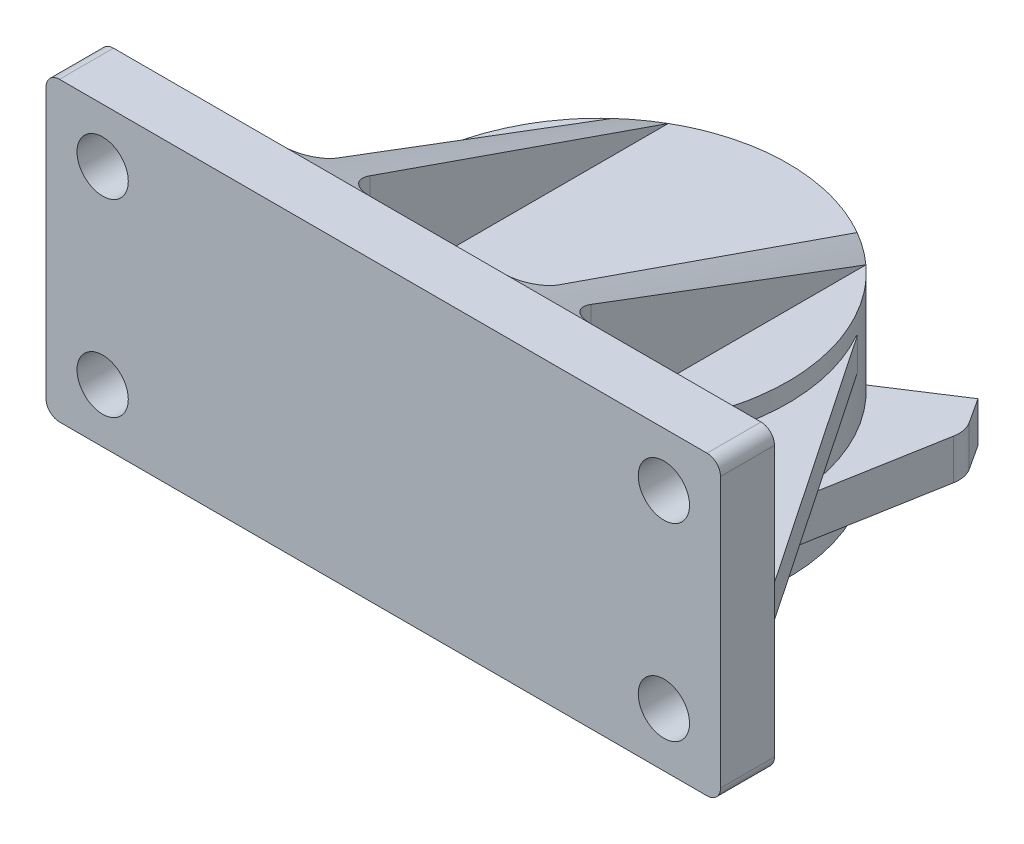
ISO-10303-21;
HEADER;
FILE_DESCRIPTION(('STEP AP214'),'2;1');
FILE_NAME('part.step','',(''),(''),'','','');
FILE_SCHEMA(('AUTOMOTIVE_DESIGN { 1 0 10303 214 1 1 1 1 }'));
ENDSEC;
DATA;
#1=APPLICATION_CONTEXT('core data for automotive mechanical design processes');
#2=APPLICATION_PROTOCOL_DEFINITION('international standard','automotive_design',2000,#1);
#3=PRODUCT_CONTEXT('',#1,'mechanical');
#4=PRODUCT('Part','Part','',(#3));
#5=PRODUCT_RELATED_PRODUCT_CATEGORY('part','',(#4));
#6=PRODUCT_DEFINITION_FORMATION('','',#4);
#7=PRODUCT_DEFINITION_CONTEXT('part definition',#1,'design');
#8=PRODUCT_DEFINITION('design','',#6,#7);
#9=PRODUCT_DEFINITION_SHAPE('','',#8);
#10=(LENGTH_UNIT() NAMED_UNIT(*) SI_UNIT(.MILLI.,.METRE.));
#11=(NAMED_UNIT(*) PLANE_ANGLE_UNIT() SI_UNIT($,.RADIAN.));
#12=(NAMED_UNIT(*) SI_UNIT($,.STERADIAN.) SOLID_ANGLE_UNIT());
#13=UNCERTAINTY_MEASURE_WITH_UNIT(LENGTH_MEASURE(1.E-05),#10,'distance_accuracy_value','');
#14=(GEOMETRIC_REPRESENTATION_CONTEXT(3) GLOBAL_UNCERTAINTY_ASSIGNED_CONTEXT((#13)) GLOBAL_UNIT_ASSIGNED_CONTEXT((#10,
#11,#12)) REPRESENTATION_CONTEXT('',''));
#15=CARTESIAN_POINT('',(0.,0.,0.));
#16=DIRECTION('',(0.,0.,1.));
#17=DIRECTION('',(1.,0.,0.));
#18=AXIS2_PLACEMENT_3D('',#15,#16,#17);
#19=CARTESIAN_POINT('',(0.,13.,-60.));
#20=DIRECTION('',(0.,-1.,0.));
#21=DIRECTION('',(0.,0.,-1.));
#22=AXIS2_PLACEMENT_3D('',#19,#20,#21);
#23=CYLINDRICAL_SURFACE('',#22,70.);
#24=CARTESIAN_POINT('',(0.,-25.,-60.));
#25=DIRECTION('',(0.,-1.,0.));
#26=DIRECTION('',(0.,0.,-1.));
#27=AXIS2_PLACEMENT_3D('',#24,#25,#26);
#28=CIRCLE('',#27,70.);
#29=CARTESIAN_POINT('',(-68.9179751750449,-25.,-47.7397920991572));
#30=VERTEX_POINT('',#29);
#31=CARTESIAN_POINT('',(-47.5729651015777,-25.,-111.349907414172));
#32=VERTEX_POINT('',#31);
#33=EDGE_CURVE('E444',#30,#32,#28,.T.);
#34=ORIENTED_EDGE('',*,*,#33,.F.);
#35=DIRECTION('',(0.,-1.,0.));
#36=VECTOR('',#35,1.);
#37=CARTESIAN_POINT('',(-68.9179751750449,-25.,-47.7397920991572));
#38=LINE('',#37,#36);
#39=CARTESIAN_POINT('',(-68.9179751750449,-40.,-47.7397920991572));
#40=VERTEX_POINT('',#39);
#41=EDGE_CURVE('E454',#30,#40,#38,.T.);
#42=ORIENTED_EDGE('',*,*,#41,.T.);
#43=CARTESIAN_POINT('',(0.,-40.,-60.));
#44=DIRECTION('',(0.,-1.,0.));
#45=DIRECTION('',(0.,0.,-1.));
#46=AXIS2_PLACEMENT_3D('',#43,#44,#45);
#47=CIRCLE('',#46,70.);
#48=CARTESIAN_POINT('',(-47.5729651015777,-40.,-111.349907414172));
#49=VERTEX_POINT('',#48);
#50=EDGE_CURVE('E434',#40,#49,#47,.T.);
#51=ORIENTED_EDGE('',*,*,#50,.T.);
#52=DIRECTION('',(0.,-1.,0.));
#53=VECTOR('',#52,1.);
#54=CARTESIAN_POINT('',(-47.5729651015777,-25.,-111.349907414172));
#55=LINE('',#54,#53);
#56=EDGE_CURVE('E455',#32,#49,#55,.T.);
#57=ORIENTED_EDGE('',*,*,#56,.F.);
#58=EDGE_LOOP('',(#34,#42,#51,#57));
#59=FACE_BOUND('',#58,.T.);
#60=DIRECTION('',(0.,-1.,0.));
#61=VECTOR('',#60,1.);
#62=CARTESIAN_POINT('',(62.7064491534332,13.,-28.8888888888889));
#63=LINE('',#62,#61);
#64=CARTESIAN_POINT('',(62.7064491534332,13.,-28.8888888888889));
#65=VERTEX_POINT('',#64);
#66=CARTESIAN_POINT('',(62.7064491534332,6.,-28.8888888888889));
#67=VERTEX_POINT('',#66);
#68=EDGE_CURVE('E886',#65,#67,#63,.T.);
#69=ORIENTED_EDGE('',*,*,#68,.T.);
#70=CARTESIAN_POINT('',(0.,6.,-60.));
#71=DIRECTION('',(0.,1.,0.));
#72=DIRECTION('',(0.,0.,1.));
#73=AXIS2_PLACEMENT_3D('',#70,#71,#72);
#74=CIRCLE('',#73,70.);
#75=CARTESIAN_POINT('',(61.0023905,6.,-94.3323222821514));
#76=VERTEX_POINT('',#75);
#77=EDGE_CURVE('E430',#67,#76,#74,.T.);
#78=ORIENTED_EDGE('',*,*,#77,.T.);
#79=DIRECTION('',(0.,-1.,0.));
#80=VECTOR('',#79,1.);
#81=CARTESIAN_POINT('',(61.0023905,13.,-94.3323222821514));
#82=LINE('',#81,#80);
#83=CARTESIAN_POINT('',(61.0023905,-6.,-94.3323222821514));
#84=VERTEX_POINT('',#83);
#85=EDGE_CURVE('E432',#76,#84,#82,.T.);
#86=ORIENTED_EDGE('',*,*,#85,.T.);
#87=CARTESIAN_POINT('',(0.,-6.,-60.));
#88=DIRECTION('',(0.,1.,0.));
#89=DIRECTION('',(0.,0.,1.));
#90=AXIS2_PLACEMENT_3D('',#87,#88,#89);
#91=CIRCLE('',#90,70.);
#92=CARTESIAN_POINT('',(62.7064491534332,-6.,-28.8888888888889));
#93=VERTEX_POINT('',#92);
#94=EDGE_CURVE('E427',#93,#84,#91,.T.);
#95=ORIENTED_EDGE('',*,*,#94,.F.);
#96=CARTESIAN_POINT('',(62.7064491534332,-50.,-28.8888888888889));
#97=VERTEX_POINT('',#96);
#98=EDGE_CURVE('E890',#93,#97,#63,.T.);
#99=ORIENTED_EDGE('',*,*,#98,.T.);
#100=CARTESIAN_POINT('',(0.,-50.,-60.));
#101=DIRECTION('',(0.,1.,0.));
#102=DIRECTION('',(0.,0.,1.));
#103=AXIS2_PLACEMENT_3D('',#100,#101,#102);
#104=CIRCLE('',#103,70.);
#105=CARTESIAN_POINT('',(-62.7064491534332,-50.,-28.8888888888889));
#106=VERTEX_POINT('',#105);
#107=EDGE_CURVE('E788',#97,#106,#104,.T.);
#108=ORIENTED_EDGE('',*,*,#107,.T.);
#109=DIRECTION('',(0.,-1.,0.));
#110=VECTOR('',#109,1.);
#111=CARTESIAN_POINT('',(-62.7064491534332,13.,-28.8888888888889));
#112=LINE('',#111,#110);
#113=CARTESIAN_POINT('',(-62.7064491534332,-6.,-28.8888888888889));
#114=VERTEX_POINT('',#113);
#115=EDGE_CURVE('E1028',#114,#106,#112,.T.);
#116=ORIENTED_EDGE('',*,*,#115,.F.);
#117=CARTESIAN_POINT('',(0.,-6.,-60.));
#118=DIRECTION('',(0.,1.,0.));
#119=DIRECTION('',(0.,0.,1.));
#120=AXIS2_PLACEMENT_3D('',#117,#118,#119);
#121=CIRCLE('',#120,70.);
#122=CARTESIAN_POINT('',(-61.0023905,-6.,-94.3323222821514));
#123=VERTEX_POINT('',#122);
#124=EDGE_CURVE('E1032',#123,#114,#121,.T.);
#125=ORIENTED_EDGE('',*,*,#124,.F.);
#126=DIRECTION('',(0.,-1.,0.));
#127=VECTOR('',#126,1.);
#128=CARTESIAN_POINT('',(-61.0023905,13.,-94.3323222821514));
#129=LINE('',#128,#127);
#130=CARTESIAN_POINT('',(-61.0023905,6.,-94.3323222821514));
#131=VERTEX_POINT('',#130);
#132=EDGE_CURVE('E1035',#131,#123,#129,.T.);
#133=ORIENTED_EDGE('',*,*,#132,.F.);
#134=CARTESIAN_POINT('',(0.,6.,-60.));
#135=DIRECTION('',(0.,1.,0.));
#136=DIRECTION('',(0.,0.,1.));
#137=AXIS2_PLACEMENT_3D('',#134,#135,#136);
#138=CIRCLE('',#137,70.);
#139=CARTESIAN_POINT('',(-62.7064491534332,6.,-28.8888888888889));
#140=VERTEX_POINT('',#139);
#141=EDGE_CURVE('E1038',#131,#140,#138,.T.);
#142=ORIENTED_EDGE('',*,*,#141,.T.);
#143=CARTESIAN_POINT('',(-62.7064491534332,13.,-28.8888888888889));
#144=VERTEX_POINT('',#143);
#145=EDGE_CURVE('E894',#144,#140,#112,.T.);
#146=ORIENTED_EDGE('',*,*,#145,.F.);
#147=CARTESIAN_POINT('',(62.7064491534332,13.,-28.8888888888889));
#148=CARTESIAN_POINT('',(64.6839978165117,13.,-32.87484430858));
#149=CARTESIAN_POINT('',(66.1410001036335,13.,-37.079090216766));
#150=CARTESIAN_POINT('',(67.5978230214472,13.,-41.2828185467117));
#151=CARTESIAN_POINT('',(68.5108761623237,13.,-45.638250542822));
#152=CARTESIAN_POINT('',(69.4237036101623,13.,-49.992605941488));
#153=CARTESIAN_POINT('',(69.7779293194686,13.,-54.4285926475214));
#154=CARTESIAN_POINT('',(70.1320674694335,13.,-58.8634828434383));
#155=CARTESIAN_POINT('',(69.9217637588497,13.,-63.3086179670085));
#156=CARTESIAN_POINT('',(69.7115120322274,13.,-67.7526543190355));
#157=CARTESIAN_POINT('',(68.9400641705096,13.,-72.1353843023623));
#158=CARTESIAN_POINT('',(68.1688069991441,13.,-76.5170309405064));
#159=CARTESIAN_POINT('',(66.8486330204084,13.,-80.7668067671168));
#160=CARTESIAN_POINT('',(65.5287853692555,13.,-85.0155321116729));
#161=CARTESIAN_POINT('',(63.6811361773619,13.,-89.0639449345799));
#162=CARTESIAN_POINT('',(61.8339332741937,13.,-93.1113798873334));
#163=CARTESIAN_POINT('',(59.4885609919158,13.,-96.8932393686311));
#164=CARTESIAN_POINT('',(57.143728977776,13.,-100.67422767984));
#165=CARTESIAN_POINT('',(54.3383955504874,13.,-104.128661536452));
#166=CARTESIAN_POINT('',(51.5336925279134,13.,-107.582319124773));
#167=CARTESIAN_POINT('',(48.3135423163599,13.,-110.653742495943));
#168=CARTESIAN_POINT('',(45.0941157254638,13.,-113.72447566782));
#169=CARTESIAN_POINT('',(41.5109836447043,13.,-116.363447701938));
#170=CARTESIAN_POINT('',(37.9286567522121,13.,-119.001826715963));
#171=CARTESIAN_POINT('',(34.0402206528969,13.,-121.165867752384));
#172=CARTESIAN_POINT('',(30.1526583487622,13.,-123.329422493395));
#173=CARTESIAN_POINT('',(26.021510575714,13.,-124.983697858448));
#174=CARTESIAN_POINT('',(21.8912911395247,13.,-126.637601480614));
#175=CARTESIAN_POINT('',(17.5839309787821,13.,-127.755482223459));
#176=CARTESIAN_POINT('',(13.27753875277,13.,-128.873111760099));
#177=CARTESIAN_POINT('',(8.86330199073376,13.,-129.436603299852));
#178=CARTESIAN_POINT('',(4.45005717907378,13.,-129.999968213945));
#179=CARTESIAN_POINT('',(0.,13.,-130.));
#180=CARTESIAN_POINT('',(-4.44905718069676,13.,-130.000031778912));
#181=CARTESIAN_POINT('',(-8.86330199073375,13.,-129.436603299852));
#182=CARTESIAN_POINT('',(-13.2765548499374,13.,-128.87330143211));
#183=CARTESIAN_POINT('',(-17.5839309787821,13.,-127.755482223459));
#184=CARTESIAN_POINT('',(-21.8903391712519,13.,-126.63791420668));
#185=CARTESIAN_POINT('',(-26.021510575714,13.,-124.983697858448));
#186=CARTESIAN_POINT('',(-30.151753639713,13.,-123.329853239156));
#187=CARTESIAN_POINT('',(-34.0402206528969,13.,-121.165867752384));
#188=CARTESIAN_POINT('',(-37.9278138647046,13.,-119.00236854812));
#189=CARTESIAN_POINT('',(-41.5109836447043,13.,-116.363447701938));
#190=CARTESIAN_POINT('',(-45.0933482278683,13.,-113.725119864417));
#191=CARTESIAN_POINT('',(-48.3135423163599,13.,-110.653742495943));
#192=CARTESIAN_POINT('',(-51.532994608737,13.,-107.583072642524));
#193=CARTESIAN_POINT('',(-54.3383955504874,13.,-104.128661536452));
#194=CARTESIAN_POINT('',(-57.1431188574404,13.,-100.675084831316));
#195=CARTESIAN_POINT('',(-59.4885609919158,13.,-96.8932393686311));
#196=CARTESIAN_POINT('',(-61.8334233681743,13.,-93.1123287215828));
#197=CARTESIAN_POINT('',(-63.6811361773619,13.,-89.0639449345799));
#198=CARTESIAN_POINT('',(-65.528392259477,13.,-85.0165618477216));
#199=CARTESIAN_POINT('',(-66.8486330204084,13.,-80.7668067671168));
#200=CARTESIAN_POINT('',(-68.1685474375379,13.,-76.5181021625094));
#201=CARTESIAN_POINT('',(-68.9400641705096,13.,-72.1353843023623));
#202=CARTESIAN_POINT('',(-69.7113901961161,13.,-67.7537497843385));
#203=CARTESIAN_POINT('',(-69.9217637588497,13.,-63.3086179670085));
#204=CARTESIAN_POINT('',(-70.1320853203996,13.,-58.8645849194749));
#205=CARTESIAN_POINT('',(-69.7779293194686,13.,-54.4285926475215));
#206=CARTESIAN_POINT('',(-69.423860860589,13.,-49.9936968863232));
#207=CARTESIAN_POINT('',(-68.5108761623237,13.,-45.638250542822));
#208=CARTESIAN_POINT('',(-67.5981171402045,13.,-41.2838808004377));
#209=CARTESIAN_POINT('',(-66.1410001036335,13.,-37.0790902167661));
#210=CARTESIAN_POINT('',(-64.6842432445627,13.,-32.8753389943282));
#211=CARTESIAN_POINT('',(-62.7064491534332,13.,-28.8888888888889));
#212=B_SPLINE_CURVE_WITH_KNOTS('',2,(#147,#148,#149,#150,#151,#152,#153,#154,#155,#156,#157,
#158,#159,#160,#161,#162,#163,#164,#165,#166,#167,#168,#169,#170,#171,#172,#173,#174,#175,#176,
#177,#178,#179,#180,#181,#182,#183,#184,#185,#186,#187,#188,#189,#190,#191,#192,#193,#194,#195,
#196,#197,#198,#199,#200,#201,#202,#203,#204,#205,#206,#207,#208,#209,#210,#211),.UNSPECIFIED.,
.F.,.F.,(3,2,2,2,2,2,2,2,2,2,2,2,2,2,2,2,2,2,2,2,2,2,2,2,2,2,2,2,2,2,2,2,3),(0.,0.03125,0.0625,
0.09375,0.125,0.15625,0.1875,0.21875,0.25,0.28125,0.3125,0.34375,0.375,0.40625,0.4375,0.46875,
0.5,0.53125,0.5625,0.59375,0.625,0.65625,0.6875,0.71875,0.75,0.78125,0.8125,0.84375,0.875,
0.90625,0.9375,0.96875,1.),.UNSPECIFIED.);
#213=CARTESIAN_POINT('',(-46.9998216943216,13.,-111.875046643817));
#214=VERTEX_POINT('',#213);
#215=EDGE_CURVE('E776',#214,#144,#212,.T.);
#216=ORIENTED_EDGE('',*,*,#215,.F.);
#217=CARTESIAN_POINT('',(-34.999983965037,13.,-120.621787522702));
#218=CARTESIAN_POINT('',(-35.5383742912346,12.9999984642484,-120.310948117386));
#219=CARTESIAN_POINT('',(-36.072599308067,12.9999908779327,-119.99294965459));
#220=CARTESIAN_POINT('',(-37.132365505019,12.9999767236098,-119.342850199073));
#221=CARTESIAN_POINT('',(-37.6579070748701,12.9999701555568,-119.010749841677));
#222=CARTESIAN_POINT('',(-39.2209799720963,12.9999716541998,-117.993621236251));
#223=CARTESIAN_POINT('',(-40.2450308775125,13.0000009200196,-117.28772423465));
#224=CARTESIAN_POINT('',(-42.2482113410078,12.9999990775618,-115.826664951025));
#225=CARTESIAN_POINT('',(-43.2275682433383,12.9999683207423,-115.071814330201));
#226=CARTESIAN_POINT('',(-44.6656860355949,12.9999664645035,-113.901380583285));
#227=CARTESIAN_POINT('',(-45.1400053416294,12.9999732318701,-113.504786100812));
#228=CARTESIAN_POINT('',(-46.0779778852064,12.9999885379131,-112.69916644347));
#229=CARTESIAN_POINT('',(-46.5416309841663,12.9999970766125,-112.290141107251));
#230=CARTESIAN_POINT('',(-46.9998039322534,13.,-111.875027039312));
#231=B_SPLINE_CURVE_WITH_KNOTS('',3,(#217,#218,#219,#220,#221,#222,#223,#224,#225,#226,#227,
#228,#229,#230),.UNSPECIFIED.,.F.,.F.,(4,2,2,2,2,2,4),(0.,1.86492760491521,3.72977127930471,
7.45921164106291,11.1668800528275,13.021519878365,14.8761837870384),.UNSPECIFIED.);
#232=CARTESIAN_POINT('',(-34.999991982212,13.,-120.621801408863));
#233=VERTEX_POINT('',#232);
#234=EDGE_CURVE('E1004',#233,#214,#231,.T.);
#235=ORIENTED_EDGE('',*,*,#234,.F.);
#236=CARTESIAN_POINT('',(62.7064491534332,13.,-28.8888888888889));
#237=CARTESIAN_POINT('',(64.6839978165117,13.,-32.87484430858));
#238=CARTESIAN_POINT('',(66.1410001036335,13.,-37.079090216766));
#239=CARTESIAN_POINT('',(67.5978230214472,13.,-41.2828185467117));
#240=CARTESIAN_POINT('',(68.5108761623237,13.,-45.638250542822));
#241=CARTESIAN_POINT('',(69.4237036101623,13.,-49.992605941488));
#242=CARTESIAN_POINT('',(69.7779293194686,13.,-54.4285926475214));
#243=CARTESIAN_POINT('',(70.1320674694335,13.,-58.8634828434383));
#244=CARTESIAN_POINT('',(69.9217637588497,13.,-63.3086179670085));
#245=CARTESIAN_POINT('',(69.7115120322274,13.,-67.7526543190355));
#246=CARTESIAN_POINT('',(68.9400641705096,13.,-72.1353843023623));
#247=CARTESIAN_POINT('',(68.1688069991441,13.,-76.5170309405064));
#248=CARTESIAN_POINT('',(66.8486330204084,13.,-80.7668067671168));
#249=CARTESIAN_POINT('',(65.5287853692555,13.,-85.0155321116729));
#250=CARTESIAN_POINT('',(63.6811361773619,13.,-89.0639449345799));
#251=CARTESIAN_POINT('',(61.8339332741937,13.,-93.1113798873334));
#252=CARTESIAN_POINT('',(59.4885609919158,13.,-96.8932393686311));
#253=CARTESIAN_POINT('',(57.143728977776,13.,-100.67422767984));
#254=CARTESIAN_POINT('',(54.3383955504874,13.,-104.128661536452));
#255=CARTESIAN_POINT('',(51.5336925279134,13.,-107.582319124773));
#256=CARTESIAN_POINT('',(48.3135423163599,13.,-110.653742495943));
#257=CARTESIAN_POINT('',(45.0941157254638,13.,-113.72447566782));
#258=CARTESIAN_POINT('',(41.5109836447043,13.,-116.363447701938));
#259=CARTESIAN_POINT('',(37.9286567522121,13.,-119.001826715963));
#260=CARTESIAN_POINT('',(34.0402206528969,13.,-121.165867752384));
#261=CARTESIAN_POINT('',(30.1526583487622,13.,-123.329422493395));
#262=CARTESIAN_POINT('',(26.021510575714,13.,-124.983697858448));
#263=CARTESIAN_POINT('',(21.8912911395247,13.,-126.637601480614));
#264=CARTESIAN_POINT('',(17.5839309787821,13.,-127.755482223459));
#265=CARTESIAN_POINT('',(13.27753875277,13.,-128.873111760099));
#266=CARTESIAN_POINT('',(8.86330199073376,13.,-129.436603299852));
#267=CARTESIAN_POINT('',(4.45005717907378,13.,-129.999968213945));
#268=CARTESIAN_POINT('',(0.,13.,-130.));
#269=CARTESIAN_POINT('',(-4.44905718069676,13.,-130.000031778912));
#270=CARTESIAN_POINT('',(-8.86330199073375,13.,-129.436603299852));
#271=CARTESIAN_POINT('',(-13.2765548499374,13.,-128.87330143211));
#272=CARTESIAN_POINT('',(-17.5839309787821,13.,-127.755482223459));
#273=CARTESIAN_POINT('',(-21.8903391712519,13.,-126.63791420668));
#274=CARTESIAN_POINT('',(-26.021510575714,13.,-124.983697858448));
#275=CARTESIAN_POINT('',(-30.151753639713,13.,-123.329853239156));
#276=CARTESIAN_POINT('',(-34.0402206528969,13.,-121.165867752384));
#277=CARTESIAN_POINT('',(-37.9278138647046,13.,-119.00236854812));
#278=CARTESIAN_POINT('',(-41.5109836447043,13.,-116.363447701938));
#279=CARTESIAN_POINT('',(-45.0933482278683,13.,-113.725119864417));
#280=CARTESIAN_POINT('',(-48.3135423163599,13.,-110.653742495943));
#281=CARTESIAN_POINT('',(-51.532994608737,13.,-107.583072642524));
#282=CARTESIAN_POINT('',(-54.3383955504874,13.,-104.128661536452));
#283=CARTESIAN_POINT('',(-57.1431188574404,13.,-100.675084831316));
#284=CARTESIAN_POINT('',(-59.4885609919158,13.,-96.8932393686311));
#285=CARTESIAN_POINT('',(-61.8334233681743,13.,-93.1123287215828));
#286=CARTESIAN_POINT('',(-63.6811361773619,13.,-89.0639449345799));
#287=CARTESIAN_POINT('',(-65.528392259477,13.,-85.0165618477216));
#288=CARTESIAN_POINT('',(-66.8486330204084,13.,-80.7668067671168));
#289=CARTESIAN_POINT('',(-68.1685474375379,13.,-76.5181021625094));
#290=CARTESIAN_POINT('',(-68.9400641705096,13.,-72.1353843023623));
#291=CARTESIAN_POINT('',(-69.7113901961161,13.,-67.7537497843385));
#292=CARTESIAN_POINT('',(-69.9217637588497,13.,-63.3086179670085));
#293=CARTESIAN_POINT('',(-70.1320853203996,13.,-58.8645849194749));
#294=CARTESIAN_POINT('',(-69.7779293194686,13.,-54.4285926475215));
#295=CARTESIAN_POINT('',(-69.423860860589,13.,-49.9936968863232));
#296=CARTESIAN_POINT('',(-68.5108761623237,13.,-45.638250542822));
#297=CARTESIAN_POINT('',(-67.5981171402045,13.,-41.2838808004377));
#298=CARTESIAN_POINT('',(-66.1410001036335,13.,-37.0790902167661));
#299=CARTESIAN_POINT('',(-64.6842432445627,13.,-32.8753389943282));
#300=CARTESIAN_POINT('',(-62.7064491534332,13.,-28.8888888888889));
#301=B_SPLINE_CURVE_WITH_KNOTS('',2,(#236,#237,#238,#239,#240,#241,#242,#243,#244,#245,#246,
#247,#248,#249,#250,#251,#252,#253,#254,#255,#256,#257,#258,#259,#260,#261,#262,#263,#264,#265,
#266,#267,#268,#269,#270,#271,#272,#273,#274,#275,#276,#277,#278,#279,#280,#281,#282,#283,#284,
#285,#286,#287,#288,#289,#290,#291,#292,#293,#294,#295,#296,#297,#298,#299,#300),.UNSPECIFIED.,
.F.,.F.,(3,2,2,2,2,2,2,2,2,2,2,2,2,2,2,2,2,2,2,2,2,2,2,2,2,2,2,2,2,2,2,2,3),(0.,0.03125,0.0625,
0.09375,0.125,0.15625,0.1875,0.21875,0.25,0.28125,0.3125,0.34375,0.375,0.40625,0.4375,0.46875,
0.5,0.53125,0.5625,0.59375,0.625,0.65625,0.6875,0.71875,0.75,0.78125,0.8125,0.84375,0.875,
0.90625,0.9375,0.96875,1.),.UNSPECIFIED.);
#302=CARTESIAN_POINT('',(34.9999999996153,13.,-120.62179077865));
#303=VERTEX_POINT('',#302);
#304=EDGE_CURVE('E761',#303,#233,#301,.T.);
#305=ORIENTED_EDGE('',*,*,#304,.F.);
#306=CARTESIAN_POINT('',(56.346515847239,13.,-103.406656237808));
#307=CARTESIAN_POINT('',(53.231010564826,13.,-106.229387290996));
#308=CARTESIAN_POINT('',(50.115505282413,13.,-109.052118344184));
#309=CARTESIAN_POINT('',(47.,13.,-111.874849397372));
#310=CARTESIAN_POINT('',(45.1659106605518,13.,-113.536583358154));
#311=CARTESIAN_POINT('',(43.2382557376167,13.,-115.105473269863));
#312=CARTESIAN_POINT('',(39.226941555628,13.,-118.029363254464));
#313=CARTESIAN_POINT('',(37.1433461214,13.,-119.384316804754));
#314=CARTESIAN_POINT('',(35.,13.,-120.621778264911));
#315=CARTESIAN_POINT('',(31.3591707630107,13.,-122.72381200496));
#316=CARTESIAN_POINT('',(27.7183415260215,13.,-124.825845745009));
#317=CARTESIAN_POINT('',(24.0775122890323,13.,-126.927879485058));
#318=B_SPLINE_CURVE_WITH_KNOTS('',3,(#306,#307,#308,#309,#310,#311,#312,#313,#314,#315,#316,
#317),.UNSPECIFIED.,.F.,.F.,(4,3,2,3,4),(-0.849333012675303,9.27832832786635E-09,
0.500000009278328,1.00000000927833,1.84933302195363),.UNSPECIFIED.);
#319=CARTESIAN_POINT('',(47.0000000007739,13.,-111.874893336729));
#320=VERTEX_POINT('',#319);
#321=EDGE_CURVE('E756',#320,#303,#318,.T.);
#322=ORIENTED_EDGE('',*,*,#321,.F.);
#323=CARTESIAN_POINT('',(62.7064491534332,13.,-28.8888888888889));
#324=CARTESIAN_POINT('',(64.6839978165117,13.,-32.87484430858));
#325=CARTESIAN_POINT('',(66.1410001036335,13.,-37.079090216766));
#326=CARTESIAN_POINT('',(67.5978230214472,13.,-41.2828185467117));
#327=CARTESIAN_POINT('',(68.5108761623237,13.,-45.638250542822));
#328=CARTESIAN_POINT('',(69.4237036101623,13.,-49.992605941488));
#329=CARTESIAN_POINT('',(69.7779293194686,13.,-54.4285926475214));
#330=CARTESIAN_POINT('',(70.1320674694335,13.,-58.8634828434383));
#331=CARTESIAN_POINT('',(69.9217637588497,13.,-63.3086179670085));
#332=CARTESIAN_POINT('',(69.7115120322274,13.,-67.7526543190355));
#333=CARTESIAN_POINT('',(68.9400641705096,13.,-72.1353843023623));
#334=CARTESIAN_POINT('',(68.1688069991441,13.,-76.5170309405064));
#335=CARTESIAN_POINT('',(66.8486330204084,13.,-80.7668067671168));
#336=CARTESIAN_POINT('',(65.5287853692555,13.,-85.0155321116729));
#337=CARTESIAN_POINT('',(63.6811361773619,13.,-89.0639449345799));
#338=CARTESIAN_POINT('',(61.8339332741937,13.,-93.1113798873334));
#339=CARTESIAN_POINT('',(59.4885609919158,13.,-96.8932393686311));
#340=CARTESIAN_POINT('',(57.143728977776,13.,-100.67422767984));
#341=CARTESIAN_POINT('',(54.3383955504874,13.,-104.128661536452));
#342=CARTESIAN_POINT('',(51.5336925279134,13.,-107.582319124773));
#343=CARTESIAN_POINT('',(48.3135423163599,13.,-110.653742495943));
#344=CARTESIAN_POINT('',(45.0941157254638,13.,-113.72447566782));
#345=CARTESIAN_POINT('',(41.5109836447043,13.,-116.363447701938));
#346=CARTESIAN_POINT('',(37.9286567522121,13.,-119.001826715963));
#347=CARTESIAN_POINT('',(34.0402206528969,13.,-121.165867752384));
#348=CARTESIAN_POINT('',(30.1526583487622,13.,-123.329422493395));
#349=CARTESIAN_POINT('',(26.021510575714,13.,-124.983697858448));
#350=CARTESIAN_POINT('',(21.8912911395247,13.,-126.637601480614));
#351=CARTESIAN_POINT('',(17.5839309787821,13.,-127.755482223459));
#352=CARTESIAN_POINT('',(13.27753875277,13.,-128.873111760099));
#353=CARTESIAN_POINT('',(8.86330199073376,13.,-129.436603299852));
#354=CARTESIAN_POINT('',(4.45005717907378,13.,-129.999968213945));
#355=CARTESIAN_POINT('',(0.,13.,-130.));
#356=CARTESIAN_POINT('',(-4.44905718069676,13.,-130.000031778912));
#357=CARTESIAN_POINT('',(-8.86330199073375,13.,-129.436603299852));
#358=CARTESIAN_POINT('',(-13.2765548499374,13.,-128.87330143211));
#359=CARTESIAN_POINT('',(-17.5839309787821,13.,-127.755482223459));
#360=CARTESIAN_POINT('',(-21.8903391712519,13.,-126.63791420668));
#361=CARTESIAN_POINT('',(-26.021510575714,13.,-124.983697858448));
#362=CARTESIAN_POINT('',(-30.151753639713,13.,-123.329853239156));
#363=CARTESIAN_POINT('',(-34.0402206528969,13.,-121.165867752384));
#364=CARTESIAN_POINT('',(-37.9278138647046,13.,-119.00236854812));
#365=CARTESIAN_POINT('',(-41.5109836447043,13.,-116.363447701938));
#366=CARTESIAN_POINT('',(-45.0933482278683,13.,-113.725119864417));
#367=CARTESIAN_POINT('',(-48.3135423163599,13.,-110.653742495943));
#368=CARTESIAN_POINT('',(-51.532994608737,13.,-107.583072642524));
#369=CARTESIAN_POINT('',(-54.3383955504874,13.,-104.128661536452));
#370=CARTESIAN_POINT('',(-57.1431188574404,13.,-100.675084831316));
#371=CARTESIAN_POINT('',(-59.4885609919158,13.,-96.8932393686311));
#372=CARTESIAN_POINT('',(-61.8334233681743,13.,-93.1123287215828));
#373=CARTESIAN_POINT('',(-63.6811361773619,13.,-89.0639449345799));
#374=CARTESIAN_POINT('',(-65.528392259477,13.,-85.0165618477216));
#375=CARTESIAN_POINT('',(-66.8486330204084,13.,-80.7668067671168));
#376=CARTESIAN_POINT('',(-68.1685474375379,13.,-76.5181021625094));
#377=CARTESIAN_POINT('',(-68.9400641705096,13.,-72.1353843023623));
#378=CARTESIAN_POINT('',(-69.7113901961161,13.,-67.7537497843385));
#379=CARTESIAN_POINT('',(-69.9217637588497,13.,-63.3086179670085));
#380=CARTESIAN_POINT('',(-70.1320853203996,13.,-58.8645849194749));
#381=CARTESIAN_POINT('',(-69.7779293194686,13.,-54.4285926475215));
#382=CARTESIAN_POINT('',(-69.423860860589,13.,-49.9936968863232));
#383=CARTESIAN_POINT('',(-68.5108761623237,13.,-45.638250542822));
#384=CARTESIAN_POINT('',(-67.5981171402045,13.,-41.2838808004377));
#385=CARTESIAN_POINT('',(-66.1410001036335,13.,-37.0790902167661));
#386=CARTESIAN_POINT('',(-64.6842432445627,13.,-32.8753389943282));
#387=CARTESIAN_POINT('',(-62.7064491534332,13.,-28.8888888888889));
#388=B_SPLINE_CURVE_WITH_KNOTS('',2,(#323,#324,#325,#326,#327,#328,#329,#330,#331,#332,#333,
#334,#335,#336,#337,#338,#339,#340,#341,#342,#343,#344,#345,#346,#347,#348,#349,#350,#351,#352,
#353,#354,#355,#356,#357,#358,#359,#360,#361,#362,#363,#364,#365,#366,#367,#368,#369,#370,#371,
#372,#373,#374,#375,#376,#377,#378,#379,#380,#381,#382,#383,#384,#385,#386,#387),.UNSPECIFIED.,
.F.,.F.,(3,2,2,2,2,2,2,2,2,2,2,2,2,2,2,2,2,2,2,2,2,2,2,2,2,2,2,2,2,2,2,2,3),(0.,0.03125,0.0625,
0.09375,0.125,0.15625,0.1875,0.21875,0.25,0.28125,0.3125,0.34375,0.375,0.40625,0.4375,0.46875,
0.5,0.53125,0.5625,0.59375,0.625,0.65625,0.6875,0.71875,0.75,0.78125,0.8125,0.84375,0.875,
0.90625,0.9375,0.96875,1.),.UNSPECIFIED.);
#389=EDGE_CURVE('E964',#65,#320,#388,.T.);
#390=ORIENTED_EDGE('',*,*,#389,.F.);
#391=EDGE_LOOP('',(#69,#78,#86,#95,#99,#108,#116,#125,#133,#142,#146,#216,#235,#305,#322,#390));
#392=FACE_BOUND('',#391,.T.);
#393=CARTESIAN_POINT('',(0.,-25.,-60.));
#394=DIRECTION('',(0.,1.,0.));
#395=DIRECTION('',(0.,0.,-1.));
#396=AXIS2_PLACEMENT_3D('',#393,#394,#395);
#397=CIRCLE('',#396,70.);
#398=CARTESIAN_POINT('',(68.9179751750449,-25.,-47.7397920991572));
#399=VERTEX_POINT('',#398);
#400=CARTESIAN_POINT('',(47.5729651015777,-25.,-111.349907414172));
#401=VERTEX_POINT('',#400);
#402=EDGE_CURVE('E394',#399,#401,#397,.T.);
#403=ORIENTED_EDGE('',*,*,#402,.T.);
#404=DIRECTION('',(0.,-1.,0.));
#405=VECTOR('',#404,1.);
#406=CARTESIAN_POINT('',(47.5729651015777,-25.,-111.349907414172));
#407=LINE('',#406,#405);
#408=CARTESIAN_POINT('',(47.5729651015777,-40.,-111.349907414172));
#409=VERTEX_POINT('',#408);
#410=EDGE_CURVE('E376',#401,#409,#407,.T.);
#411=ORIENTED_EDGE('',*,*,#410,.T.);
#412=CARTESIAN_POINT('',(0.,-40.,-60.));
#413=DIRECTION('',(0.,1.,0.));
#414=DIRECTION('',(0.,0.,-1.));
#415=AXIS2_PLACEMENT_3D('',#412,#413,#414);
#416=CIRCLE('',#415,70.);
#417=CARTESIAN_POINT('',(68.9179751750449,-40.,-47.7397920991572));
#418=VERTEX_POINT('',#417);
#419=EDGE_CURVE('E383',#418,#409,#416,.T.);
#420=ORIENTED_EDGE('',*,*,#419,.F.);
#421=DIRECTION('',(0.,-1.,0.));
#422=VECTOR('',#421,1.);
#423=CARTESIAN_POINT('',(68.9179751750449,-25.,-47.7397920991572));
#424=LINE('',#423,#422);
#425=EDGE_CURVE('E397',#399,#418,#424,.T.);
#426=ORIENTED_EDGE('',*,*,#425,.F.);
#427=EDGE_LOOP('',(#403,#411,#420,#426));
#428=FACE_BOUND('',#427,.T.);
#429=ADVANCED_FACE('F65',(#59,#392,#428),#23,.T.);
#430=CARTESIAN_POINT('',(-125.,55.,0.));
#431=DIRECTION('',(0.,0.,1.));
#432=DIRECTION('',(1.,0.,0.));
#433=AXIS2_PLACEMENT_3D('',#430,#431,#432);
#434=PLANE('',#433);
#435=CARTESIAN_POINT('',(-104.,-35.,0.));
#436=DIRECTION('',(0.,0.,-1.));
#437=DIRECTION('',(-1.,0.,0.));
#438=AXIS2_PLACEMENT_3D('',#435,#436,#437);
#439=CIRCLE('',#438,9.5);
#440=CARTESIAN_POINT('',(-113.5,-35.,0.));
#441=VERTEX_POINT('',#440);
#442=EDGE_CURVE('E504',#441,#441,#439,.T.);
#443=ORIENTED_EDGE('',*,*,#442,.F.);
#444=EDGE_LOOP('',(#443));
#445=FACE_BOUND('',#444,.T.);
#446=CARTESIAN_POINT('',(104.,-35.,0.));
#447=DIRECTION('',(0.,0.,-1.));
#448=DIRECTION('',(-1.,0.,0.));
#449=AXIS2_PLACEMENT_3D('',#446,#447,#448);
#450=CIRCLE('',#449,9.5);
#451=CARTESIAN_POINT('',(94.5,-35.,0.));
#452=VERTEX_POINT('',#451);
#453=EDGE_CURVE('E508',#452,#452,#450,.T.);
#454=ORIENTED_EDGE('',*,*,#453,.F.);
#455=EDGE_LOOP('',(#454));
#456=FACE_BOUND('',#455,.T.);
#457=DIRECTION('',(1.,0.,0.));
#458=VECTOR('',#457,1.);
#459=CARTESIAN_POINT('',(-125.,-55.,0.));
#460=LINE('',#459,#458);
#461=CARTESIAN_POINT('',(-120.,-55.,0.));
#462=VERTEX_POINT('',#461);
#463=CARTESIAN_POINT('',(120.,-55.,0.));
#464=VERTEX_POINT('',#463);
#465=EDGE_CURVE('E864',#462,#464,#460,.T.);
#466=ORIENTED_EDGE('',*,*,#465,.F.);
#467=CARTESIAN_POINT('',(-120.,-50.,0.));
#468=DIRECTION('',(0.,0.,1.));
#469=DIRECTION('',(1.,0.,0.));
#470=AXIS2_PLACEMENT_3D('',#467,#468,#469);
#471=CIRCLE('',#470,5.);
#472=CARTESIAN_POINT('',(-125.,-50.,0.));
#473=VERTEX_POINT('',#472);
#474=EDGE_CURVE('E849',#462,#473,#471,.F.);
#475=ORIENTED_EDGE('',*,*,#474,.T.);
#476=DIRECTION('',(0.,-1.,0.));
#477=VECTOR('',#476,1.);
#478=CARTESIAN_POINT('',(-125.,55.,0.));
#479=LINE('',#478,#477);
#480=CARTESIAN_POINT('',(-125.,-6.,0.));
#481=VERTEX_POINT('',#480);
#482=EDGE_CURVE('E868',#481,#473,#479,.T.);
#483=ORIENTED_EDGE('',*,*,#482,.F.);
#484=DIRECTION('',(1.,0.,0.));
#485=VECTOR('',#484,1.);
#486=CARTESIAN_POINT('',(-125.,-6.,0.));
#487=LINE('',#486,#485);
#488=CARTESIAN_POINT('',(-80.6225774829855,-6.,0.));
#489=VERTEX_POINT('',#488);
#490=EDGE_CURVE('E469',#481,#489,#487,.T.);
#491=ORIENTED_EDGE('',*,*,#490,.T.);
#492=DIRECTION('',(0.,-1.,0.));
#493=VECTOR('',#492,1.);
#494=CARTESIAN_POINT('',(-80.6225774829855,13.,0.));
#495=LINE('',#494,#493);
#496=CARTESIAN_POINT('',(-80.6225774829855,-50.,0.));
#497=VERTEX_POINT('',#496);
#498=EDGE_CURVE('E872',#489,#497,#495,.T.);
#499=ORIENTED_EDGE('',*,*,#498,.T.);
#500=DIRECTION('',(1.,0.,0.));
#501=VECTOR('',#500,1.);
#502=CARTESIAN_POINT('',(-80.6225774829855,-50.,0.));
#503=LINE('',#502,#501);
#504=CARTESIAN_POINT('',(80.6225774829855,-50.,0.));
#505=VERTEX_POINT('',#504);
#506=EDGE_CURVE('E1018',#497,#505,#503,.T.);
#507=ORIENTED_EDGE('',*,*,#506,.T.);
#508=DIRECTION('',(0.,-1.,0.));
#509=VECTOR('',#508,1.);
#510=CARTESIAN_POINT('',(80.6225774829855,13.,0.));
#511=LINE('',#510,#509);
#512=CARTESIAN_POINT('',(80.6225774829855,-5.99999999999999,0.));
#513=VERTEX_POINT('',#512);
#514=EDGE_CURVE('E881',#513,#505,#511,.T.);
#515=ORIENTED_EDGE('',*,*,#514,.F.);
#516=DIRECTION('',(-1.,0.,0.));
#517=VECTOR('',#516,1.);
#518=CARTESIAN_POINT('',(125.,-6.,0.));
#519=LINE('',#518,#517);
#520=CARTESIAN_POINT('',(125.,-6.,0.));
#521=VERTEX_POINT('',#520);
#522=EDGE_CURVE('E407',#521,#513,#519,.T.);
#523=ORIENTED_EDGE('',*,*,#522,.F.);
#524=DIRECTION('',(0.,1.,0.));
#525=VECTOR('',#524,1.);
#526=CARTESIAN_POINT('',(125.,55.,0.));
#527=LINE('',#526,#525);
#528=CARTESIAN_POINT('',(125.,-50.,0.));
#529=VERTEX_POINT('',#528);
#530=EDGE_CURVE('E812',#529,#521,#527,.T.);
#531=ORIENTED_EDGE('',*,*,#530,.F.);
#532=CARTESIAN_POINT('',(120.,-50.,0.));
#533=DIRECTION('',(0.,0.,1.));
#534=DIRECTION('',(1.,0.,0.));
#535=AXIS2_PLACEMENT_3D('',#532,#533,#534);
#536=CIRCLE('',#535,5.);
#537=EDGE_CURVE('E88',#529,#464,#536,.F.);
#538=ORIENTED_EDGE('',*,*,#537,.T.);
#539=EDGE_LOOP('',(#466,#475,#483,#491,#499,#507,#515,#523,#531,#538));
#540=FACE_BOUND('',#539,.T.);
#541=ADVANCED_FACE('F712',(#445,#456,#540),#434,.F.);
#542=CARTESIAN_POINT('',(104.,35.,0.));
#543=DIRECTION('',(0.,0.,-1.));
#544=DIRECTION('',(-1.,0.,0.));
#545=AXIS2_PLACEMENT_3D('',#542,#543,#544);
#546=CIRCLE('',#545,9.5);
#547=CARTESIAN_POINT('',(94.5,35.,0.));
#548=VERTEX_POINT('',#547);
#549=EDGE_CURVE('E512',#548,#548,#546,.T.);
#550=ORIENTED_EDGE('',*,*,#549,.F.);
#551=EDGE_LOOP('',(#550));
#552=FACE_BOUND('',#551,.T.);
#553=DIRECTION('',(-1.,0.,0.));
#554=VECTOR('',#553,1.);
#555=CARTESIAN_POINT('',(-125.,55.,0.));
#556=LINE('',#555,#554);
#557=CARTESIAN_POINT('',(120.,55.,0.));
#558=VERTEX_POINT('',#557);
#559=CARTESIAN_POINT('',(56.9999963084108,55.,6.81746326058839E-13));
#560=VERTEX_POINT('',#559);
#561=EDGE_CURVE('E824',#558,#560,#556,.T.);
#562=ORIENTED_EDGE('',*,*,#561,.F.);
#563=CARTESIAN_POINT('',(120.,50.,0.));
#564=DIRECTION('',(0.,0.,1.));
#565=DIRECTION('',(1.,0.,0.));
#566=AXIS2_PLACEMENT_3D('',#563,#564,#565);
#567=CIRCLE('',#566,5.);
#568=CARTESIAN_POINT('',(125.,50.,0.));
#569=VERTEX_POINT('',#568);
#570=EDGE_CURVE('E80',#558,#569,#567,.F.);
#571=ORIENTED_EDGE('',*,*,#570,.T.);
#572=CARTESIAN_POINT('',(125.,6.,0.));
#573=VERTEX_POINT('',#572);
#574=EDGE_CURVE('E863',#573,#569,#527,.T.);
#575=ORIENTED_EDGE('',*,*,#574,.F.);
#576=DIRECTION('',(-1.,0.,0.));
#577=VECTOR('',#576,1.);
#578=CARTESIAN_POINT('',(125.,6.,0.));
#579=LINE('',#578,#577);
#580=CARTESIAN_POINT('',(80.6225774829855,6.,0.));
#581=VERTEX_POINT('',#580);
#582=EDGE_CURVE('E416',#573,#581,#579,.T.);
#583=ORIENTED_EDGE('',*,*,#582,.T.);
#584=CARTESIAN_POINT('',(80.6225774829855,13.,0.));
#585=VERTEX_POINT('',#584);
#586=EDGE_CURVE('E790',#585,#581,#511,.T.);
#587=ORIENTED_EDGE('',*,*,#586,.F.);
#588=DIRECTION('',(1.,0.,0.));
#589=VECTOR('',#588,1.);
#590=CARTESIAN_POINT('',(-80.6225774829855,13.,0.));
#591=LINE('',#590,#589);
#592=CARTESIAN_POINT('',(57.,13.,0.));
#593=VERTEX_POINT('',#592);
#594=EDGE_CURVE('E798',#593,#585,#591,.T.);
#595=ORIENTED_EDGE('',*,*,#594,.F.);
#596=DIRECTION('',(0.,-1.,0.));
#597=VECTOR('',#596,1.);
#598=CARTESIAN_POINT('',(57.,55.,0.));
#599=LINE('',#598,#597);
#600=EDGE_CURVE('E973',#593,#560,#599,.F.);
#601=ORIENTED_EDGE('',*,*,#600,.T.);
#602=EDGE_LOOP('',(#562,#571,#575,#583,#587,#595,#601));
#603=FACE_BOUND('',#602,.T.);
#604=ADVANCED_FACE('F719',(#552,#603),#434,.F.);
#605=CARTESIAN_POINT('',(-104.,35.,0.));
#606=DIRECTION('',(0.,0.,-1.));
#607=DIRECTION('',(-1.,0.,0.));
#608=AXIS2_PLACEMENT_3D('',#605,#606,#607);
#609=CIRCLE('',#608,9.5);
#610=CARTESIAN_POINT('',(-113.5,35.,0.));
#611=VERTEX_POINT('',#610);
#612=EDGE_CURVE('E500',#611,#611,#609,.T.);
#613=ORIENTED_EDGE('',*,*,#612,.F.);
#614=EDGE_LOOP('',(#613));
#615=FACE_BOUND('',#614,.T.);
#616=CARTESIAN_POINT('',(-125.,50.,0.));
#617=VERTEX_POINT('',#616);
#618=CARTESIAN_POINT('',(-125.,6.,0.));
#619=VERTEX_POINT('',#618);
#620=EDGE_CURVE('E866',#617,#619,#479,.T.);
#621=ORIENTED_EDGE('',*,*,#620,.F.);
#622=CARTESIAN_POINT('',(-120.,50.,0.));
#623=DIRECTION('',(0.,0.,1.));
#624=DIRECTION('',(1.,0.,0.));
#625=AXIS2_PLACEMENT_3D('',#622,#623,#624);
#626=CIRCLE('',#625,5.);
#627=CARTESIAN_POINT('',(-120.,55.,0.));
#628=VERTEX_POINT('',#627);
#629=EDGE_CURVE('E833',#617,#628,#626,.F.);
#630=ORIENTED_EDGE('',*,*,#629,.T.);
#631=CARTESIAN_POINT('',(-57.,55.,0.));
#632=VERTEX_POINT('',#631);
#633=EDGE_CURVE('E807',#632,#628,#556,.T.);
#634=ORIENTED_EDGE('',*,*,#633,.F.);
#635=DIRECTION('',(0.,1.,0.));
#636=VECTOR('',#635,1.);
#637=CARTESIAN_POINT('',(-57.,13.,0.));
#638=LINE('',#637,#636);
#639=CARTESIAN_POINT('',(-57.,13.,0.));
#640=VERTEX_POINT('',#639);
#641=EDGE_CURVE('E806',#632,#640,#638,.F.);
#642=ORIENTED_EDGE('',*,*,#641,.T.);
#643=CARTESIAN_POINT('',(-80.6225774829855,13.,0.));
#644=VERTEX_POINT('',#643);
#645=EDGE_CURVE('E778',#644,#640,#591,.T.);
#646=ORIENTED_EDGE('',*,*,#645,.F.);
#647=CARTESIAN_POINT('',(-80.6225774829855,6.,0.));
#648=VERTEX_POINT('',#647);
#649=EDGE_CURVE('E870',#644,#648,#495,.T.);
#650=ORIENTED_EDGE('',*,*,#649,.T.);
#651=DIRECTION('',(1.,0.,0.));
#652=VECTOR('',#651,1.);
#653=CARTESIAN_POINT('',(-125.,6.,0.));
#654=LINE('',#653,#652);
#655=EDGE_CURVE('E478',#619,#648,#654,.T.);
#656=ORIENTED_EDGE('',*,*,#655,.F.);
#657=EDGE_LOOP('',(#621,#630,#634,#642,#646,#650,#656));
#658=FACE_BOUND('',#657,.T.);
#659=ADVANCED_FACE('F721',(#615,#658),#434,.F.);
#660=CARTESIAN_POINT('',(25.,55.,0.));
#661=VERTEX_POINT('',#660);
#662=CARTESIAN_POINT('',(-25.0000038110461,55.,7.25114412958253E-13));
#663=VERTEX_POINT('',#662);
#664=EDGE_CURVE('E811',#661,#663,#556,.T.);
#665=ORIENTED_EDGE('',*,*,#664,.F.);
#666=DIRECTION('',(0.,1.,0.));
#667=VECTOR('',#666,1.);
#668=CARTESIAN_POINT('',(25.,13.,0.));
#669=LINE('',#668,#667);
#670=CARTESIAN_POINT('',(25.,13.,0.));
#671=VERTEX_POINT('',#670);
#672=EDGE_CURVE('E982',#661,#671,#669,.F.);
#673=ORIENTED_EDGE('',*,*,#672,.T.);
#674=CARTESIAN_POINT('',(-25.,13.,0.));
#675=VERTEX_POINT('',#674);
#676=EDGE_CURVE('E782',#675,#671,#591,.T.);
#677=ORIENTED_EDGE('',*,*,#676,.F.);
#678=DIRECTION('',(0.,-1.,0.));
#679=VECTOR('',#678,1.);
#680=CARTESIAN_POINT('',(-25.,55.,0.));
#681=LINE('',#680,#679);
#682=EDGE_CURVE('E976',#675,#663,#681,.F.);
#683=ORIENTED_EDGE('',*,*,#682,.T.);
#684=EDGE_LOOP('',(#665,#673,#677,#683));
#685=FACE_BOUND('',#684,.T.);
#686=ADVANCED_FACE('F1172',(#685),#434,.F.);
#687=CARTESIAN_POINT('',(-80.6225774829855,13.,-20.));
#688=DIRECTION('',(0.,-1.,0.));
#689=DIRECTION('',(0.,0.,-1.));
#690=AXIS2_PLACEMENT_3D('',#687,#688,#689);
#691=PLANE('',#690);
#692=DIRECTION('',(0.,0.,1.));
#693=VECTOR('',#692,1.);
#694=CARTESIAN_POINT('',(47.,13.,0.));
#695=LINE('',#694,#693);
#696=CARTESIAN_POINT('',(47.,13.,-10.));
#697=VERTEX_POINT('',#696);
#698=EDGE_CURVE('E959',#320,#697,#695,.T.);
#699=ORIENTED_EDGE('',*,*,#698,.T.);
#700=CARTESIAN_POINT('',(57.,13.,-10.));
#701=DIRECTION('',(0.,-1.,0.));
#702=DIRECTION('',(0.,0.,-1.));
#703=AXIS2_PLACEMENT_3D('',#700,#701,#702);
#704=CIRCLE('',#703,10.);
#705=EDGE_CURVE('E804',#697,#593,#704,.F.);
#706=ORIENTED_EDGE('',*,*,#705,.T.);
#707=ORIENTED_EDGE('',*,*,#594,.T.);
#708=CARTESIAN_POINT('',(80.6225774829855,13.,-20.));
#709=DIRECTION('',(0.,-1.,0.));
#710=DIRECTION('',(0.,0.,1.));
#711=AXIS2_PLACEMENT_3D('',#708,#709,#710);
#712=CIRCLE('',#711,20.);
#713=EDGE_CURVE('E739',#585,#65,#712,.T.);
#714=ORIENTED_EDGE('',*,*,#713,.T.);
#715=ORIENTED_EDGE('',*,*,#389,.T.);
#716=EDGE_LOOP('',(#699,#706,#707,#714,#715));
#717=FACE_BOUND('',#716,.T.);
#718=ADVANCED_FACE('F962',(#717),#691,.F.);
#719=ORIENTED_EDGE('',*,*,#676,.T.);
#720=CARTESIAN_POINT('',(25.,13.,-10.));
#721=DIRECTION('',(0.,-1.,0.));
#722=DIRECTION('',(0.,0.,-1.));
#723=AXIS2_PLACEMENT_3D('',#720,#721,#722);
#724=CIRCLE('',#723,10.);
#725=CARTESIAN_POINT('',(35.,13.,-10.));
#726=VERTEX_POINT('',#725);
#727=EDGE_CURVE('E997',#671,#726,#724,.F.);
#728=ORIENTED_EDGE('',*,*,#727,.T.);
#729=DIRECTION('',(0.,0.,-1.));
#730=VECTOR('',#729,1.);
#731=CARTESIAN_POINT('',(35.,13.,0.));
#732=LINE('',#731,#730);
#733=EDGE_CURVE('E966',#726,#303,#732,.T.);
#734=ORIENTED_EDGE('',*,*,#733,.T.);
#735=ORIENTED_EDGE('',*,*,#304,.T.);
#736=DIRECTION('',(0.,0.,-1.));
#737=VECTOR('',#736,1.);
#738=CARTESIAN_POINT('',(-35.,13.,0.));
#739=LINE('',#738,#737);
#740=CARTESIAN_POINT('',(-35.,13.,-10.));
#741=VERTEX_POINT('',#740);
#742=EDGE_CURVE('E1001',#741,#233,#739,.T.);
#743=ORIENTED_EDGE('',*,*,#742,.F.);
#744=CARTESIAN_POINT('',(-25.,13.,-10.));
#745=DIRECTION('',(0.,-1.,0.));
#746=DIRECTION('',(0.,0.,-1.));
#747=AXIS2_PLACEMENT_3D('',#744,#745,#746);
#748=CIRCLE('',#747,10.);
#749=EDGE_CURVE('E999',#741,#675,#748,.F.);
#750=ORIENTED_EDGE('',*,*,#749,.T.);
#751=EDGE_LOOP('',(#719,#728,#734,#735,#743,#750));
#752=FACE_BOUND('',#751,.T.);
#753=ADVANCED_FACE('F1170',(#752),#691,.F.);
#754=CARTESIAN_POINT('',(-125.,55.,20.));
#755=DIRECTION('',(1.,0.,0.));
#756=DIRECTION('',(0.,0.,-1.));
#757=AXIS2_PLACEMENT_3D('',#754,#755,#756);
#758=PLANE('',#757);
#759=DIRECTION('',(0.,-1.,0.));
#760=VECTOR('',#759,1.);
#761=CARTESIAN_POINT('',(-125.,55.,20.));
#762=LINE('',#761,#760);
#763=CARTESIAN_POINT('',(-125.,50.,20.));
#764=VERTEX_POINT('',#763);
#765=CARTESIAN_POINT('',(-125.,-50.,20.));
#766=VERTEX_POINT('',#765);
#767=EDGE_CURVE('E818',#764,#766,#762,.T.);
#768=ORIENTED_EDGE('',*,*,#767,.F.);
#769=DIRECTION('',(0.,0.,-1.));
#770=VECTOR('',#769,1.);
#771=CARTESIAN_POINT('',(-125.,50.,20.));
#772=LINE('',#771,#770);
#773=EDGE_CURVE('E928',#764,#617,#772,.T.);
#774=ORIENTED_EDGE('',*,*,#773,.T.);
#775=ORIENTED_EDGE('',*,*,#620,.T.);
#776=DIRECTION('',(0.,-1.,0.));
#777=VECTOR('',#776,1.);
#778=CARTESIAN_POINT('',(-125.,6.,0.));
#779=LINE('',#778,#777);
#780=EDGE_CURVE('E481',#619,#481,#779,.T.);
#781=ORIENTED_EDGE('',*,*,#780,.T.);
#782=ORIENTED_EDGE('',*,*,#482,.T.);
#783=DIRECTION('',(0.,0.,-1.));
#784=VECTOR('',#783,1.);
#785=CARTESIAN_POINT('',(-125.,-50.,20.));
#786=LINE('',#785,#784);
#787=EDGE_CURVE('E926',#473,#766,#786,.F.);
#788=ORIENTED_EDGE('',*,*,#787,.T.);
#789=EDGE_LOOP('',(#768,#774,#775,#781,#782,#788));
#790=FACE_BOUND('',#789,.T.);
#791=ADVANCED_FACE('F67',(#790),#758,.F.);
#792=CARTESIAN_POINT('',(-125.,-55.,20.));
#793=DIRECTION('',(0.,1.,0.));
#794=DIRECTION('',(-1.,0.,0.));
#795=AXIS2_PLACEMENT_3D('',#792,#793,#794);
#796=PLANE('',#795);
#797=DIRECTION('',(1.,0.,0.));
#798=VECTOR('',#797,1.);
#799=CARTESIAN_POINT('',(-125.,-55.,20.));
#800=LINE('',#799,#798);
#801=CARTESIAN_POINT('',(-120.,-55.,20.));
#802=VERTEX_POINT('',#801);
#803=CARTESIAN_POINT('',(120.,-55.,20.));
#804=VERTEX_POINT('',#803);
#805=EDGE_CURVE('E947',#802,#804,#800,.T.);
#806=ORIENTED_EDGE('',*,*,#805,.F.);
#807=DIRECTION('',(0.,0.,-1.));
#808=VECTOR('',#807,1.);
#809=CARTESIAN_POINT('',(-120.,-55.,20.));
#810=LINE('',#809,#808);
#811=EDGE_CURVE('E845',#802,#462,#810,.T.);
#812=ORIENTED_EDGE('',*,*,#811,.T.);
#813=ORIENTED_EDGE('',*,*,#465,.T.);
#814=DIRECTION('',(0.,0.,-1.));
#815=VECTOR('',#814,1.);
#816=CARTESIAN_POINT('',(120.,-55.,20.));
#817=LINE('',#816,#815);
#818=EDGE_CURVE('E843',#464,#804,#817,.F.);
#819=ORIENTED_EDGE('',*,*,#818,.T.);
#820=EDGE_LOOP('',(#806,#812,#813,#819));
#821=FACE_BOUND('',#820,.T.);
#822=ADVANCED_FACE('F1442',(#821),#796,.F.);
#823=CARTESIAN_POINT('',(125.,55.,20.));
#824=DIRECTION('',(-1.,0.,0.));
#825=DIRECTION('',(0.,0.,1.));
#826=AXIS2_PLACEMENT_3D('',#823,#824,#825);
#827=PLANE('',#826);
#828=ORIENTED_EDGE('',*,*,#574,.T.);
#829=DIRECTION('',(0.,0.,-1.));
#830=VECTOR('',#829,1.);
#831=CARTESIAN_POINT('',(125.,50.,20.));
#832=LINE('',#831,#830);
#833=CARTESIAN_POINT('',(125.,50.,20.));
#834=VERTEX_POINT('',#833);
#835=EDGE_CURVE('E12',#569,#834,#832,.F.);
#836=ORIENTED_EDGE('',*,*,#835,.T.);
#837=DIRECTION('',(0.,1.,0.));
#838=VECTOR('',#837,1.);
#839=CARTESIAN_POINT('',(125.,55.,20.));
#840=LINE('',#839,#838);
#841=CARTESIAN_POINT('',(125.,-50.,20.));
#842=VERTEX_POINT('',#841);
#843=EDGE_CURVE('E857',#842,#834,#840,.T.);
#844=ORIENTED_EDGE('',*,*,#843,.F.);
#845=DIRECTION('',(0.,0.,-1.));
#846=VECTOR('',#845,1.);
#847=CARTESIAN_POINT('',(125.,-50.,20.));
#848=LINE('',#847,#846);
#849=EDGE_CURVE('E73',#842,#529,#848,.T.);
#850=ORIENTED_EDGE('',*,*,#849,.T.);
#851=ORIENTED_EDGE('',*,*,#530,.T.);
#852=DIRECTION('',(0.,-1.,0.));
#853=VECTOR('',#852,1.);
#854=CARTESIAN_POINT('',(125.,6.,0.));
#855=LINE('',#854,#853);
#856=EDGE_CURVE('E424',#573,#521,#855,.T.);
#857=ORIENTED_EDGE('',*,*,#856,.F.);
#858=EDGE_LOOP('',(#828,#836,#844,#850,#851,#857));
#859=FACE_BOUND('',#858,.T.);
#860=ADVANCED_FACE('F608',(#859),#827,.F.);
#861=CARTESIAN_POINT('',(-125.,55.,20.));
#862=DIRECTION('',(0.,-1.,0.));
#863=DIRECTION('',(1.,0.,0.));
#864=AXIS2_PLACEMENT_3D('',#861,#862,#863);
#865=PLANE('',#864);
#866=ORIENTED_EDGE('',*,*,#633,.T.);
#867=DIRECTION('',(0.,0.,-1.));
#868=VECTOR('',#867,1.);
#869=CARTESIAN_POINT('',(-120.,55.,20.));
#870=LINE('',#869,#868);
#871=CARTESIAN_POINT('',(-120.,55.,20.));
#872=VERTEX_POINT('',#871);
#873=EDGE_CURVE('E832',#628,#872,#870,.F.);
#874=ORIENTED_EDGE('',*,*,#873,.T.);
#875=DIRECTION('',(-1.,0.,0.));
#876=VECTOR('',#875,1.);
#877=CARTESIAN_POINT('',(-125.,55.,20.));
#878=LINE('',#877,#876);
#879=CARTESIAN_POINT('',(120.,55.,20.));
#880=VERTEX_POINT('',#879);
#881=EDGE_CURVE('E827',#880,#872,#878,.T.);
#882=ORIENTED_EDGE('',*,*,#881,.F.);
#883=DIRECTION('',(0.,0.,-1.));
#884=VECTOR('',#883,1.);
#885=CARTESIAN_POINT('',(120.,55.,20.));
#886=LINE('',#885,#884);
#887=EDGE_CURVE('E829',#880,#558,#886,.T.);
#888=ORIENTED_EDGE('',*,*,#887,.T.);
#889=ORIENTED_EDGE('',*,*,#561,.T.);
#890=CARTESIAN_POINT('',(47.,55.,0.));
#891=CARTESIAN_POINT('',(48.2427056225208,55.,0.));
#892=CARTESIAN_POINT('',(49.4854112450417,55.,0.));
#893=CARTESIAN_POINT('',(52.8187433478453,55.,0.));
#894=CARTESIAN_POINT('',(54.9093698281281,55.,0.));
#895=CARTESIAN_POINT('',(56.9999963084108,55.,0.));
#896=B_SPLINE_CURVE_WITH_KNOTS('',3,(#890,#891,#892,#893,#894,#895),.UNSPECIFIED.,.F.,.F.,(4,2,
4),(0.,3.72811686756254,9.99999630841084),.UNSPECIFIED.);
#897=CARTESIAN_POINT('',(47.,55.,0.));
#898=VERTEX_POINT('',#897);
#899=EDGE_CURVE('E599',#898,#560,#896,.T.);
#900=ORIENTED_EDGE('',*,*,#899,.F.);
#901=DIRECTION('',(1.,0.,0.));
#902=VECTOR('',#901,1.);
#903=CARTESIAN_POINT('',(35.,55.,0.));
#904=LINE('',#903,#902);
#905=CARTESIAN_POINT('',(35.,55.,0.));
#906=VERTEX_POINT('',#905);
#907=EDGE_CURVE('E528',#906,#898,#904,.T.);
#908=ORIENTED_EDGE('',*,*,#907,.F.);
#909=CARTESIAN_POINT('',(35.,55.,0.));
#910=CARTESIAN_POINT('',(33.7572943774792,55.,0.));
#911=CARTESIAN_POINT('',(32.5145887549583,55.,0.));
#912=CARTESIAN_POINT('',(29.1812566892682,55.,0.));
#913=CARTESIAN_POINT('',(27.0906302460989,55.,0.));
#914=CARTESIAN_POINT('',(25.0000038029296,55.,0.));
#915=B_SPLINE_CURVE_WITH_KNOTS('',3,(#909,#910,#911,#912,#913,#914),.UNSPECIFIED.,.F.,.F.,(4,2,
4),(0.,3.72811686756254,9.99999619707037),.UNSPECIFIED.);
#916=EDGE_CURVE('E601',#906,#661,#915,.T.);
#917=ORIENTED_EDGE('',*,*,#916,.T.);
#918=ORIENTED_EDGE('',*,*,#664,.T.);
#919=CARTESIAN_POINT('',(-35.,55.,0.));
#920=CARTESIAN_POINT('',(-33.7448673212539,55.,0.));
#921=CARTESIAN_POINT('',(-32.4897346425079,55.,0.));
#922=CARTESIAN_POINT('',(-29.1564025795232,55.,0.));
#923=CARTESIAN_POINT('',(-27.0782031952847,55.,0.));
#924=CARTESIAN_POINT('',(-25.0000038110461,55.,0.));
#925=B_SPLINE_CURVE_WITH_KNOTS('',3,(#919,#920,#921,#922,#923,#924),.UNSPECIFIED.,.F.,.F.,(4,2,
4),(0.,3.76539803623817,9.99999618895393),.UNSPECIFIED.);
#926=CARTESIAN_POINT('',(-35.,55.,0.));
#927=VERTEX_POINT('',#926);
#928=EDGE_CURVE('E641',#927,#663,#925,.T.);
#929=ORIENTED_EDGE('',*,*,#928,.F.);
#930=DIRECTION('',(-1.,0.,0.));
#931=VECTOR('',#930,1.);
#932=CARTESIAN_POINT('',(-35.,55.,0.));
#933=LINE('',#932,#931);
#934=CARTESIAN_POINT('',(-47.,55.,0.));
#935=VERTEX_POINT('',#934);
#936=EDGE_CURVE('E965',#927,#935,#933,.T.);
#937=ORIENTED_EDGE('',*,*,#936,.T.);
#938=CARTESIAN_POINT('',(-47.,55.,0.));
#939=CARTESIAN_POINT('',(-48.2551326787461,55.,0.));
#940=CARTESIAN_POINT('',(-49.5102653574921,55.,0.));
#941=CARTESIAN_POINT('',(-52.8435974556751,55.,0.));
#942=CARTESIAN_POINT('',(-54.921796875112,55.,0.));
#943=CARTESIAN_POINT('',(-56.999996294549,55.,0.));
#944=B_SPLINE_CURVE_WITH_KNOTS('',3,(#938,#939,#940,#941,#942,#943),.UNSPECIFIED.,.F.,.F.,(4,2,
4),(0.,3.76539803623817,9.99999629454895),.UNSPECIFIED.);
#945=EDGE_CURVE('E642',#935,#632,#944,.T.);
#946=ORIENTED_EDGE('',*,*,#945,.T.);
#947=EDGE_LOOP('',(#866,#874,#882,#888,#889,#900,#908,#917,#918,#929,#937,#946));
#948=FACE_BOUND('',#947,.T.);
#949=ADVANCED_FACE('F602',(#948),#865,.F.);
#950=CARTESIAN_POINT('',(-125.,55.,20.));
#951=DIRECTION('',(0.,0.,1.));
#952=DIRECTION('',(1.,0.,0.));
#953=AXIS2_PLACEMENT_3D('',#950,#951,#952);
#954=PLANE('',#953);
#955=CARTESIAN_POINT('',(-104.,35.,20.));
#956=DIRECTION('',(0.,0.,1.));
#957=DIRECTION('',(1.,0.,0.));
#958=AXIS2_PLACEMENT_3D('',#955,#956,#957);
#959=CIRCLE('',#958,9.5);
#960=CARTESIAN_POINT('',(-94.5,35.,20.));
#961=VERTEX_POINT('',#960);
#962=EDGE_CURVE('E503',#961,#961,#959,.T.);
#963=ORIENTED_EDGE('',*,*,#962,.F.);
#964=EDGE_LOOP('',(#963));
#965=FACE_BOUND('',#964,.T.);
#966=CARTESIAN_POINT('',(-104.,-35.,20.));
#967=DIRECTION('',(0.,0.,1.));
#968=DIRECTION('',(1.,0.,0.));
#969=AXIS2_PLACEMENT_3D('',#966,#967,#968);
#970=CIRCLE('',#969,9.5);
#971=CARTESIAN_POINT('',(-94.5,-35.,20.));
#972=VERTEX_POINT('',#971);
#973=EDGE_CURVE('E507',#972,#972,#970,.T.);
#974=ORIENTED_EDGE('',*,*,#973,.F.);
#975=EDGE_LOOP('',(#974));
#976=FACE_BOUND('',#975,.T.);
#977=CARTESIAN_POINT('',(104.,-35.,20.));
#978=DIRECTION('',(0.,0.,1.));
#979=DIRECTION('',(1.,0.,0.));
#980=AXIS2_PLACEMENT_3D('',#977,#978,#979);
#981=CIRCLE('',#980,9.5);
#982=CARTESIAN_POINT('',(113.5,-35.,20.));
#983=VERTEX_POINT('',#982);
#984=EDGE_CURVE('E511',#983,#983,#981,.T.);
#985=ORIENTED_EDGE('',*,*,#984,.F.);
#986=EDGE_LOOP('',(#985));
#987=FACE_BOUND('',#986,.T.);
#988=CARTESIAN_POINT('',(104.,35.,20.));
#989=DIRECTION('',(0.,0.,1.));
#990=DIRECTION('',(1.,0.,0.));
#991=AXIS2_PLACEMENT_3D('',#988,#989,#990);
#992=CIRCLE('',#991,9.5);
#993=CARTESIAN_POINT('',(113.5,35.,20.));
#994=VERTEX_POINT('',#993);
#995=EDGE_CURVE('E515',#994,#994,#992,.T.);
#996=ORIENTED_EDGE('',*,*,#995,.F.);
#997=EDGE_LOOP('',(#996));
#998=FACE_BOUND('',#997,.T.);
#999=ORIENTED_EDGE('',*,*,#881,.T.);
#1000=CARTESIAN_POINT('',(-120.,50.,20.));
#1001=DIRECTION('',(0.,0.,1.));
#1002=DIRECTION('',(1.,0.,0.));
#1003=AXIS2_PLACEMENT_3D('',#1000,#1001,#1002);
#1004=CIRCLE('',#1003,5.);
#1005=EDGE_CURVE('E841',#872,#764,#1004,.T.);
#1006=ORIENTED_EDGE('',*,*,#1005,.T.);
#1007=ORIENTED_EDGE('',*,*,#767,.T.);
#1008=CARTESIAN_POINT('',(-120.,-50.,20.));
#1009=DIRECTION('',(0.,0.,1.));
#1010=DIRECTION('',(1.,0.,0.));
#1011=AXIS2_PLACEMENT_3D('',#1008,#1009,#1010);
#1012=CIRCLE('',#1011,5.);
#1013=EDGE_CURVE('E839',#766,#802,#1012,.T.);
#1014=ORIENTED_EDGE('',*,*,#1013,.T.);
#1015=ORIENTED_EDGE('',*,*,#805,.T.);
#1016=CARTESIAN_POINT('',(120.,-50.,20.));
#1017=DIRECTION('',(0.,0.,1.));
#1018=DIRECTION('',(1.,0.,0.));
#1019=AXIS2_PLACEMENT_3D('',#1016,#1017,#1018);
#1020=CIRCLE('',#1019,5.);
#1021=EDGE_CURVE('E835',#804,#842,#1020,.T.);
#1022=ORIENTED_EDGE('',*,*,#1021,.T.);
#1023=ORIENTED_EDGE('',*,*,#843,.T.);
#1024=CARTESIAN_POINT('',(120.,50.,20.));
#1025=DIRECTION('',(0.,0.,1.));
#1026=DIRECTION('',(1.,0.,0.));
#1027=AXIS2_PLACEMENT_3D('',#1024,#1025,#1026);
#1028=CIRCLE('',#1027,5.);
#1029=EDGE_CURVE('E837',#834,#880,#1028,.T.);
#1030=ORIENTED_EDGE('',*,*,#1029,.T.);
#1031=EDGE_LOOP('',(#999,#1006,#1007,#1014,#1015,#1022,#1023,#1030));
#1032=FACE_BOUND('',#1031,.T.);
#1033=ADVANCED_FACE('F607',(#965,#976,#987,#998,#1032),#954,.T.);
#1034=CARTESIAN_POINT('',(-80.6225774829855,13.,-20.));
#1035=DIRECTION('',(0.,-1.,0.));
#1036=DIRECTION('',(0.,0.,-1.));
#1037=AXIS2_PLACEMENT_3D('',#1034,#1035,#1036);
#1038=CYLINDRICAL_SURFACE('',#1037,20.);
#1039=ORIENTED_EDGE('',*,*,#145,.T.);
#1040=CARTESIAN_POINT('',(-80.6225774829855,6.,-20.));
#1041=DIRECTION('',(0.,1.,0.));
#1042=DIRECTION('',(0.,0.,1.));
#1043=AXIS2_PLACEMENT_3D('',#1040,#1041,#1042);
#1044=CIRCLE('',#1043,20.);
#1045=CARTESIAN_POINT('',(-61.0023905,6.,-23.8792090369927));
#1046=VERTEX_POINT('',#1045);
#1047=EDGE_CURVE('E491',#140,#1046,#1044,.F.);
#1048=ORIENTED_EDGE('',*,*,#1047,.T.);
#1049=DIRECTION('',(0.,-1.,0.));
#1050=VECTOR('',#1049,1.);
#1051=CARTESIAN_POINT('',(-61.0023905,13.,-23.8792090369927));
#1052=LINE('',#1051,#1050);
#1053=CARTESIAN_POINT('',(-61.0023905,-6.,-23.8792090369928));
#1054=VERTEX_POINT('',#1053);
#1055=EDGE_CURVE('E497',#1054,#1046,#1052,.F.);
#1056=ORIENTED_EDGE('',*,*,#1055,.F.);
#1057=CARTESIAN_POINT('',(-80.6225774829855,-6.,-20.));
#1058=DIRECTION('',(0.,1.,0.));
#1059=DIRECTION('',(0.,0.,1.));
#1060=AXIS2_PLACEMENT_3D('',#1057,#1058,#1059);
#1061=CIRCLE('',#1060,20.);
#1062=EDGE_CURVE('E487',#114,#1054,#1061,.F.);
#1063=ORIENTED_EDGE('',*,*,#1062,.F.);
#1064=ORIENTED_EDGE('',*,*,#115,.T.);
#1065=CARTESIAN_POINT('',(-80.6225774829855,-50.,-20.));
#1066=DIRECTION('',(0.,-1.,0.));
#1067=DIRECTION('',(0.,0.,-1.));
#1068=AXIS2_PLACEMENT_3D('',#1065,#1066,#1067);
#1069=CIRCLE('',#1068,20.);
#1070=EDGE_CURVE('E1015',#106,#497,#1069,.T.);
#1071=ORIENTED_EDGE('',*,*,#1070,.T.);
#1072=ORIENTED_EDGE('',*,*,#498,.F.);
#1073=CARTESIAN_POINT('',(-61.0023905,-6.,-16.1207909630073));
#1074=VERTEX_POINT('',#1073);
#1075=EDGE_CURVE('E490',#1074,#489,#1061,.F.);
#1076=ORIENTED_EDGE('',*,*,#1075,.F.);
#1077=DIRECTION('',(0.,-1.,0.));
#1078=VECTOR('',#1077,1.);
#1079=CARTESIAN_POINT('',(-61.0023905,13.,-16.1207909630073));
#1080=LINE('',#1079,#1078);
#1081=CARTESIAN_POINT('',(-61.0023905,6.,-16.1207909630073));
#1082=VERTEX_POINT('',#1081);
#1083=EDGE_CURVE('E494',#1082,#1074,#1080,.T.);
#1084=ORIENTED_EDGE('',*,*,#1083,.F.);
#1085=EDGE_CURVE('E493',#1082,#648,#1044,.F.);
#1086=ORIENTED_EDGE('',*,*,#1085,.T.);
#1087=ORIENTED_EDGE('',*,*,#649,.F.);
#1088=CARTESIAN_POINT('',(-80.6225774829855,13.,-20.));
#1089=DIRECTION('',(0.,-1.,0.));
#1090=DIRECTION('',(0.,0.,-1.));
#1091=AXIS2_PLACEMENT_3D('',#1088,#1089,#1090);
#1092=CIRCLE('',#1091,20.);
#1093=EDGE_CURVE('E801',#144,#644,#1092,.T.);
#1094=ORIENTED_EDGE('',*,*,#1093,.F.);
#1095=EDGE_LOOP('',(#1039,#1048,#1056,#1063,#1064,#1071,#1072,#1076,#1084,#1086,#1087,#1094));
#1096=FACE_BOUND('',#1095,.T.);
#1097=ADVANCED_FACE('F1138',(#1096),#1038,.F.);
#1098=CARTESIAN_POINT('',(80.6225774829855,13.,-20.));
#1099=DIRECTION('',(0.,-1.,0.));
#1100=DIRECTION('',(0.,0.,-1.));
#1101=AXIS2_PLACEMENT_3D('',#1098,#1099,#1100);
#1102=CYLINDRICAL_SURFACE('',#1101,20.);
#1103=ORIENTED_EDGE('',*,*,#586,.T.);
#1104=CARTESIAN_POINT('',(80.6225774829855,6.,-20.));
#1105=DIRECTION('',(0.,1.,0.));
#1106=DIRECTION('',(0.,0.,1.));
#1107=AXIS2_PLACEMENT_3D('',#1104,#1105,#1106);
#1108=CIRCLE('',#1107,20.);
#1109=CARTESIAN_POINT('',(61.0023905,6.,-16.1207909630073));
#1110=VERTEX_POINT('',#1109);
#1111=EDGE_CURVE('E914',#581,#1110,#1108,.F.);
#1112=ORIENTED_EDGE('',*,*,#1111,.T.);
#1113=DIRECTION('',(0.,-1.,0.));
#1114=VECTOR('',#1113,1.);
#1115=CARTESIAN_POINT('',(61.0023905,13.,-16.1207909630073));
#1116=LINE('',#1115,#1114);
#1117=CARTESIAN_POINT('',(61.0023905,-6.,-16.1207909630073));
#1118=VERTEX_POINT('',#1117);
#1119=EDGE_CURVE('E915',#1110,#1118,#1116,.T.);
#1120=ORIENTED_EDGE('',*,*,#1119,.T.);
#1121=CARTESIAN_POINT('',(80.6225774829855,-6.,-20.));
#1122=DIRECTION('',(0.,1.,0.));
#1123=DIRECTION('',(0.,0.,1.));
#1124=AXIS2_PLACEMENT_3D('',#1121,#1122,#1123);
#1125=CIRCLE('',#1124,20.);
#1126=EDGE_CURVE('E910',#513,#1118,#1125,.F.);
#1127=ORIENTED_EDGE('',*,*,#1126,.F.);
#1128=ORIENTED_EDGE('',*,*,#514,.T.);
#1129=CARTESIAN_POINT('',(80.6225774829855,-50.,-20.));
#1130=DIRECTION('',(0.,-1.,0.));
#1131=DIRECTION('',(0.,0.,1.));
#1132=AXIS2_PLACEMENT_3D('',#1129,#1130,#1131);
#1133=CIRCLE('',#1132,20.);
#1134=EDGE_CURVE('E1022',#505,#97,#1133,.T.);
#1135=ORIENTED_EDGE('',*,*,#1134,.T.);
#1136=ORIENTED_EDGE('',*,*,#98,.F.);
#1137=CARTESIAN_POINT('',(61.0023905,-6.,-23.8792090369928));
#1138=VERTEX_POINT('',#1137);
#1139=EDGE_CURVE('E906',#1138,#93,#1125,.F.);
#1140=ORIENTED_EDGE('',*,*,#1139,.F.);
#1141=DIRECTION('',(0.,-1.,0.));
#1142=VECTOR('',#1141,1.);
#1143=CARTESIAN_POINT('',(61.0023905,13.,-23.8792090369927));
#1144=LINE('',#1143,#1142);
#1145=CARTESIAN_POINT('',(61.0023905,6.,-23.8792090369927));
#1146=VERTEX_POINT('',#1145);
#1147=EDGE_CURVE('E909',#1138,#1146,#1144,.F.);
#1148=ORIENTED_EDGE('',*,*,#1147,.T.);
#1149=EDGE_CURVE('E912',#1146,#67,#1108,.F.);
#1150=ORIENTED_EDGE('',*,*,#1149,.T.);
#1151=ORIENTED_EDGE('',*,*,#68,.F.);
#1152=ORIENTED_EDGE('',*,*,#713,.F.);
#1153=EDGE_LOOP('',(#1103,#1112,#1120,#1127,#1128,#1135,#1136,#1140,#1148,#1150,#1151,#1152));
#1154=FACE_BOUND('',#1153,.T.);
#1155=ADVANCED_FACE('F729',(#1154),#1102,.F.);
#1156=ORIENTED_EDGE('',*,*,#645,.T.);
#1157=CARTESIAN_POINT('',(-57.,13.,-10.));
#1158=DIRECTION('',(0.,-1.,0.));
#1159=DIRECTION('',(0.,0.,-1.));
#1160=AXIS2_PLACEMENT_3D('',#1157,#1158,#1159);
#1161=CIRCLE('',#1160,10.);
#1162=CARTESIAN_POINT('',(-47.,13.,-10.));
#1163=VERTEX_POINT('',#1162);
#1164=EDGE_CURVE('E986',#640,#1163,#1161,.F.);
#1165=ORIENTED_EDGE('',*,*,#1164,.T.);
#1166=DIRECTION('',(0.,0.,1.));
#1167=VECTOR('',#1166,1.);
#1168=CARTESIAN_POINT('',(-47.,13.,0.));
#1169=LINE('',#1168,#1167);
#1170=EDGE_CURVE('E1011',#214,#1163,#1169,.T.);
#1171=ORIENTED_EDGE('',*,*,#1170,.F.);
#1172=ORIENTED_EDGE('',*,*,#215,.T.);
#1173=ORIENTED_EDGE('',*,*,#1093,.T.);
#1174=EDGE_LOOP('',(#1156,#1165,#1171,#1172,#1173));
#1175=FACE_BOUND('',#1174,.T.);
#1176=ADVANCED_FACE('F727',(#1175),#691,.F.);
#1177=CARTESIAN_POINT('',(-80.6225774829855,-50.,-20.));
#1178=DIRECTION('',(0.,-1.,0.));
#1179=DIRECTION('',(0.,0.,-1.));
#1180=AXIS2_PLACEMENT_3D('',#1177,#1178,#1179);
#1181=PLANE('',#1180);
#1182=CARTESIAN_POINT('',(0.,-50.,-60.));
#1183=DIRECTION('',(0.,-1.,0.));
#1184=DIRECTION('',(0.,0.,-1.));
#1185=AXIS2_PLACEMENT_3D('',#1182,#1183,#1184);
#1186=CIRCLE('',#1185,52.5);
#1187=CARTESIAN_POINT('',(0.,-50.,-112.5));
#1188=VERTEX_POINT('',#1187);
#1189=EDGE_CURVE('E522',#1188,#1188,#1186,.T.);
#1190=ORIENTED_EDGE('',*,*,#1189,.F.);
#1191=EDGE_LOOP('',(#1190));
#1192=FACE_BOUND('',#1191,.T.);
#1193=ORIENTED_EDGE('',*,*,#1070,.F.);
#1194=ORIENTED_EDGE('',*,*,#107,.F.);
#1195=ORIENTED_EDGE('',*,*,#1134,.F.);
#1196=ORIENTED_EDGE('',*,*,#506,.F.);
#1197=EDGE_LOOP('',(#1193,#1194,#1195,#1196));
#1198=FACE_BOUND('',#1197,.T.);
#1199=ADVANCED_FACE('F1132',(#1192,#1198),#1181,.T.);
#1200=CARTESIAN_POINT('',(-47.,13.,0.));
#1201=DIRECTION('',(1.,0.,0.));
#1202=DIRECTION('',(0.,0.,-1.));
#1203=AXIS2_PLACEMENT_3D('',#1200,#1201,#1202);
#1204=PLANE('',#1203);
#1205=ORIENTED_EDGE('',*,*,#1170,.T.);
#1206=DIRECTION('',(0.,1.,0.));
#1207=VECTOR('',#1206,1.);
#1208=CARTESIAN_POINT('',(-47.,55.,-10.));
#1209=LINE('',#1208,#1207);
#1210=CARTESIAN_POINT('',(-47.,51.245805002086,-9.99999999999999));
#1211=VERTEX_POINT('',#1210);
#1212=EDGE_CURVE('E991',#1163,#1211,#1209,.T.);
#1213=ORIENTED_EDGE('',*,*,#1212,.T.);
#1214=DIRECTION('',(0.,0.351467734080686,0.936199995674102));
#1215=VECTOR('',#1214,1.);
#1216=CARTESIAN_POINT('',(-47.,13.,-111.874849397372));
#1217=LINE('',#1216,#1215);
#1218=EDGE_CURVE('E1005',#214,#1211,#1217,.T.);
#1219=ORIENTED_EDGE('',*,*,#1218,.F.);
#1220=EDGE_LOOP('',(#1205,#1213,#1219));
#1221=FACE_BOUND('',#1220,.T.);
#1222=ADVANCED_FACE('F651',(#1221),#1204,.F.);
#1223=CARTESIAN_POINT('',(-35.,63.3480933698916,23.9752825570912));
#1224=DIRECTION('',(-1.,0.,0.));
#1225=DIRECTION('',(0.,0.,1.));
#1226=AXIS2_PLACEMENT_3D('',#1223,#1224,#1225);
#1227=PLANE('',#1226);
#1228=DIRECTION('',(0.,0.328832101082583,0.94438839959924));
#1229=VECTOR('',#1228,1.);
#1230=CARTESIAN_POINT('',(-35.,13.,-120.621778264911));
#1231=LINE('',#1230,#1229);
#1232=CARTESIAN_POINT('',(-35.,51.5180417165,-10.));
#1233=VERTEX_POINT('',#1232);
#1234=EDGE_CURVE('E968',#233,#1233,#1231,.T.);
#1235=ORIENTED_EDGE('',*,*,#1234,.T.);
#1236=DIRECTION('',(0.,-1.,0.));
#1237=VECTOR('',#1236,1.);
#1238=CARTESIAN_POINT('',(-35.,13.,-10.));
#1239=LINE('',#1238,#1237);
#1240=EDGE_CURVE('E992',#1233,#741,#1239,.T.);
#1241=ORIENTED_EDGE('',*,*,#1240,.T.);
#1242=ORIENTED_EDGE('',*,*,#742,.T.);
#1243=EDGE_LOOP('',(#1235,#1241,#1242));
#1244=FACE_BOUND('',#1243,.T.);
#1245=ADVANCED_FACE('F649',(#1244),#1227,.F.);
#1246=CARTESIAN_POINT('',(-24.0702073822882,12.58,-128.197158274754));
#1247=CARTESIAN_POINT('',(-24.0775122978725,13.,-126.927879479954));
#1248=CARTESIAN_POINT('',(-24.8080038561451,55.,0.));
#1249=CARTESIAN_POINT('',(-27.6705759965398,12.58,-126.099100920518));
#1250=CARTESIAN_POINT('',(-27.675474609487,13.,-124.850594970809));
#1251=CARTESIAN_POINT('',(-28.1653359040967,55.,0.));
#1252=CARTESIAN_POINT('',(-31.2709446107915,12.58,-124.001043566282));
#1253=CARTESIAN_POINT('',(-31.2734369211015,13.,-122.773310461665));
#1254=CARTESIAN_POINT('',(-31.5226679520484,55.,0.));
#1255=CARTESIAN_POINT('',(-34.8713132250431,12.58,-121.902986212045));
#1256=CARTESIAN_POINT('',(-34.871399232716,13.,-120.69602595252));
#1257=CARTESIAN_POINT('',(-34.88,55.,0.));
#1258=CARTESIAN_POINT('',(-34.9142088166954,12.58,-121.87798949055));
#1259=CARTESIAN_POINT('',(-34.914266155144,13.,-120.671276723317));
#1260=CARTESIAN_POINT('',(-34.92,55.,0.));
#1261=CARTESIAN_POINT('',(-34.9571044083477,12.58,-121.852992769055));
#1262=CARTESIAN_POINT('',(-34.957133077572,13.,-120.646527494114));
#1263=CARTESIAN_POINT('',(-34.96,55.,0.));
#1264=CARTESIAN_POINT('',(-35.,12.58,-121.82799604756));
#1265=CARTESIAN_POINT('',(-35.,13.,-120.621778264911));
#1266=CARTESIAN_POINT('',(-35.,55.,0.));
#1267=CARTESIAN_POINT('',(-37.144779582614,12.58,-120.578159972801));
#1268=CARTESIAN_POINT('',(-37.1433461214,13.,-119.384316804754));
#1269=CARTESIAN_POINT('',(-37.,55.,0.));
#1270=CARTESIAN_POINT('',(-39.2292109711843,12.58,-119.209656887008));
#1271=CARTESIAN_POINT('',(-39.226941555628,13.,-118.029363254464));
#1272=CARTESIAN_POINT('',(-39.,55.,0.));
#1273=CARTESIAN_POINT('',(-43.2406382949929,12.58,-116.256528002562));
#1274=CARTESIAN_POINT('',(-43.2382557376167,13.,-115.105473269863));
#1275=CARTESIAN_POINT('',(-43.,55.,0.));
#1276=CARTESIAN_POINT('',(-45.1675697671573,12.58,-114.671949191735));
#1277=CARTESIAN_POINT('',(-45.1659106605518,13.,-113.536583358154));
#1278=CARTESIAN_POINT('',(-45.,55.,0.));
#1279=CARTESIAN_POINT('',(-47.,12.58,-112.993597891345));
#1280=CARTESIAN_POINT('',(-47.,13.,-111.874849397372));
#1281=CARTESIAN_POINT('',(-47.,55.,0.));
#1282=CARTESIAN_POINT('',(-50.1126870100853,12.58,-110.14263953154));
#1283=CARTESIAN_POINT('',(-50.1155052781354,13.,-109.052118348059));
#1284=CARTESIAN_POINT('',(-50.3973320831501,55.,0.));
#1285=CARTESIAN_POINT('',(-53.2253740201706,12.58,-107.291681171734));
#1286=CARTESIAN_POINT('',(-53.2310105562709,13.,-106.229387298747));
#1287=CARTESIAN_POINT('',(-53.7946641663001,55.,0.));
#1288=CARTESIAN_POINT('',(-56.3380610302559,12.58,-104.440722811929));
#1289=CARTESIAN_POINT('',(-56.3465158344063,13.,-103.406656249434));
#1290=CARTESIAN_POINT('',(-57.1919962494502,55.,0.));
#1291=B_SPLINE_SURFACE_WITH_KNOTS('',3,1,((#1246,#1247,#1248),(#1249,#1250,#1251),(#1252,#1253,
#1254),(#1255,#1256,#1257),(#1258,#1259,#1260),(#1261,#1262,#1263),(#1264,#1265,#1266),(#1267,
#1268,#1269),(#1270,#1271,#1272),(#1273,#1274,#1275),(#1276,#1277,#1278),(#1279,#1280,#1281),
(#1282,#1283,#1284),(#1285,#1286,#1287),(#1288,#1289,#1290)),.UNSPECIFIED.,.F.,.F.,.F.,(4,3,3,2,
3,4),(2,1,2),(-0.849333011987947,-0.01,0.,0.5,1.,1.84933302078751),(-0.01,0.,1.),.UNSPECIFIED.);
#1292=CARTESIAN_POINT('',(-47.,51.245805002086,-10.));
#1293=CARTESIAN_POINT('',(-46.9999765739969,51.3566127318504,-9.70484126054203));
#1294=CARTESIAN_POINT('',(-47.013067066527,51.4671018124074,-9.40955633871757));
#1295=CARTESIAN_POINT('',(-47.0653760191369,51.6868519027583,-8.82081938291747));
#1296=CARTESIAN_POINT('',(-47.104596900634,51.7961127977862,-8.52736752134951));
#1297=CARTESIAN_POINT('',(-47.2091249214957,52.0129156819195,-7.94411272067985));
#1298=CARTESIAN_POINT('',(-47.2744610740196,52.12045562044,-7.65431421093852));
#1299=CARTESIAN_POINT('',(-47.4309404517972,52.3330668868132,-7.08085248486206));
#1300=CARTESIAN_POINT('',(-47.5220825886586,52.4381383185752,-6.79718901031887));
#1301=CARTESIAN_POINT('',(-47.7298923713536,52.6453086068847,-6.23778713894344));
#1302=CARTESIAN_POINT('',(-47.8465918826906,52.7474035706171,-5.96205912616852));
#1303=CARTESIAN_POINT('',(-48.1048720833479,52.9478173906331,-5.42107676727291));
#1304=CARTESIAN_POINT('',(-48.2464524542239,53.0461362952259,-5.15582228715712));
#1305=CARTESIAN_POINT('',(-48.5536476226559,53.2382470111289,-4.63812839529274));
#1306=CARTESIAN_POINT('',(-48.7192470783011,53.332041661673,-4.3856809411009));
#1307=CARTESIAN_POINT('',(-49.0736056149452,53.5144503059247,-3.89560000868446));
#1308=CARTESIAN_POINT('',(-49.2623637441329,53.6030645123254,-3.65796592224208));
#1309=CARTESIAN_POINT('',(-49.6554726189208,53.771615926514,-3.20702607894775));
#1310=CARTESIAN_POINT('',(-49.8591278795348,53.8517404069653,-2.99318409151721));
#1311=CARTESIAN_POINT('',(-50.2858083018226,54.0057381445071,-2.58332095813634));
#1312=CARTESIAN_POINT('',(-50.5088322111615,54.0796118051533,-2.38729866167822));
#1313=CARTESIAN_POINT('',(-50.9728457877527,54.2204107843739,-2.01489334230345));
#1314=CARTESIAN_POINT('',(-51.2138390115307,54.2873347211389,-1.83851422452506));
#1315=CARTESIAN_POINT('',(-51.7120501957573,54.4134890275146,-1.50723496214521));
#1316=CARTESIAN_POINT('',(-51.9692668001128,54.472720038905,-1.35233302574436));
#1317=CARTESIAN_POINT('',(-52.4823143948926,54.5795074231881,-1.07416376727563));
#1318=CARTESIAN_POINT('',(-52.7373236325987,54.6275477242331,-0.949565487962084));
#1319=CARTESIAN_POINT('',(-53.2581758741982,54.7156000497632,-0.722096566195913));
#1320=CARTESIAN_POINT('',(-53.5240178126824,54.7556128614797,-0.619223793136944));
#1321=CARTESIAN_POINT('',(-54.0641816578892,54.8270109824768,-0.436415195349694));
#1322=CARTESIAN_POINT('',(-54.3384911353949,54.8584083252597,-0.35644737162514));
#1323=CARTESIAN_POINT('',(-54.8936770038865,54.9121365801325,-0.220170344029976));
#1324=CARTESIAN_POINT('',(-55.1745503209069,54.9344716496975,-0.163850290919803));
#1325=CARTESIAN_POINT('',(-55.7124757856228,54.9679049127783,-0.0798794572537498));
#1326=CARTESIAN_POINT('',(-55.9691162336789,54.979900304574,-0.0499330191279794));
#1327=CARTESIAN_POINT('',(-56.4838291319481,54.995947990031,-0.00999121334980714));
#1328=CARTESIAN_POINT('',(-56.7418990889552,55.0000113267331,3.18920067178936E-05));
#1329=CARTESIAN_POINT('',(-56.9999962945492,55.,6.86950496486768E-13));
#1330=B_SPLINE_CURVE_WITH_KNOTS('',3,(#1292,#1293,#1294,#1295,#1296,#1297,#1298,#1299,#1300,
#1301,#1302,#1303,#1304,#1305,#1306,#1307,#1308,#1309,#1310,#1311,#1312,#1313,#1314,#1315,#1316,
#1317,#1318,#1319,#1320,#1321,#1322,#1323,#1324,#1325,#1326,#1327,#1328,#1329),.UNSPECIFIED.,
.F.,.F.,(4,2,2,2,2,2,2,2,2,2,2,2,2,2,2,2,2,2,4),(0.,0.945557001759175,1.89120163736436,
2.83789978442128,3.78455800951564,4.73240333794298,5.68023653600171,6.62746696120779,
7.57465846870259,8.49142927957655,9.40814085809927,10.3250343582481,11.2418513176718,
12.1043192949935,12.966702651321,13.8278752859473,14.6886523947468,15.4637502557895,
16.2377682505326),.UNSPECIFIED.);
#1331=EDGE_CURVE('E683',#1211,#632,#1330,.T.);
#1332=CARTESIAN_POINT('',(-25.0000038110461,55.,7.25114412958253E-13));
#1333=CARTESIAN_POINT('',(-25.2702069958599,55.0000126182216,3.70376421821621E-05));
#1334=CARTESIAN_POINT('',(-25.5404031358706,54.9963733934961,-0.0109500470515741));
#1335=CARTESIAN_POINT('',(-26.0787933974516,54.9817957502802,-0.0547026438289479));
#1336=CARTESIAN_POINT('',(-26.34698777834,54.9708582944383,-0.0874652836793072));
#1337=CARTESIAN_POINT('',(-26.8788946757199,54.9417195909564,-0.174407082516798));
#1338=CARTESIAN_POINT('',(-27.1426154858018,54.9235337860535,-0.228540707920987));
#1339=CARTESIAN_POINT('',(-27.6642803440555,54.8799916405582,-0.357707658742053));
#1340=CARTESIAN_POINT('',(-27.9222243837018,54.8546352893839,-0.432741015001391));
#1341=CARTESIAN_POINT('',(-28.4305483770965,54.7969092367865,-0.603022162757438));
#1342=CARTESIAN_POINT('',(-28.6809280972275,54.7645393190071,-0.698270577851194));
#1343=CARTESIAN_POINT('',(-29.1724363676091,54.6930114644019,-0.908125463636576));
#1344=CARTESIAN_POINT('',(-29.4135646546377,54.6538533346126,-1.02273248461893));
#1345=CARTESIAN_POINT('',(-29.8850364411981,54.569030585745,-1.27031922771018));
#1346=CARTESIAN_POINT('',(-30.1153784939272,54.5233650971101,-1.40330140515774));
#1347=CARTESIAN_POINT('',(-30.5638276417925,54.4258728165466,-1.68650769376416));
#1348=CARTESIAN_POINT('',(-30.7819345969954,54.3740459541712,-1.83673200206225));
#1349=CARTESIAN_POINT('',(-31.2089240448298,54.2635109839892,-2.15641516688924));
#1350=CARTESIAN_POINT('',(-31.4175305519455,54.2046848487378,-2.32620174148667));
#1351=CARTESIAN_POINT('',(-31.819500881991,54.0814772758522,-2.68110007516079));
#1352=CARTESIAN_POINT('',(-32.0128645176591,54.0170957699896,-2.86621202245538));
#1353=CARTESIAN_POINT('',(-32.3833286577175,53.8832628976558,-3.25035821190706));
#1354=CARTESIAN_POINT('',(-32.5604285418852,53.8138113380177,-3.44939298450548));
#1355=CARTESIAN_POINT('',(-32.8975410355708,53.6703289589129,-3.86001299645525));
#1356=CARTESIAN_POINT('',(-33.0575472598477,53.5962964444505,-4.07160288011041));
#1357=CARTESIAN_POINT('',(-33.3675427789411,53.4402392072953,-4.51714797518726));
#1358=CARTESIAN_POINT('',(-33.5165747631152,53.357999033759,-4.75169409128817));
#1359=CARTESIAN_POINT('',(-33.7941648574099,53.1896691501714,-5.23140549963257));
#1360=CARTESIAN_POINT('',(-33.9227149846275,53.1035779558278,-5.47657488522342));
#1361=CARTESIAN_POINT('',(-34.1586785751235,52.9282401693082,-5.97572326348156));
#1362=CARTESIAN_POINT('',(-34.266096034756,52.8389941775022,-6.22970057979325));
#1363=CARTESIAN_POINT('',(-34.4594029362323,52.6579535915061,-6.74493905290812));
#1364=CARTESIAN_POINT('',(-34.545285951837,52.5661582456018,-7.00620235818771));
#1365=CARTESIAN_POINT('',(-34.6832996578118,52.3953516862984,-7.49258256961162));
#1366=CARTESIAN_POINT('',(-34.7386180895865,52.316609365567,-7.71689642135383));
#1367=CARTESIAN_POINT('',(-34.8335568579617,52.1581962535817,-8.16849936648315));
#1368=CARTESIAN_POINT('',(-34.8731775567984,52.0785254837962,-8.39578839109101));
#1369=CARTESIAN_POINT('',(-34.9365544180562,51.918771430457,-8.85202716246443));
#1370=CARTESIAN_POINT('',(-34.9603345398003,51.8386889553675,-9.08097386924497));
#1371=CARTESIAN_POINT('',(-34.9920612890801,51.678376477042,-9.53993197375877));
#1372=CARTESIAN_POINT('',(-35.0000065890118,51.5981464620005,-9.7699434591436));
#1373=CARTESIAN_POINT('',(-35.,51.5180417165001,-10.));
#1374=B_SPLINE_CURVE_WITH_KNOTS('',3,(#1332,#1333,#1334,#1335,#1336,#1337,#1338,#1339,#1340,
#1341,#1342,#1343,#1344,#1345,#1346,#1347,#1348,#1349,#1350,#1351,#1352,#1353,#1354,#1355,#1356,
#1357,#1358,#1359,#1360,#1361,#1362,#1363,#1364,#1365,#1366,#1367,#1368,#1369,#1370,#1371,#1372,
#1373),.UNSPECIFIED.,.F.,.F.,(4,2,2,2,2,2,2,2,2,2,2,2,2,2,2,2,2,2,2,2,4),(0.,0.810351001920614,
1.62059513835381,2.42912218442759,3.23765042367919,4.04620360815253,4.85477978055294,
5.66346410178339,6.47215767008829,7.29721620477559,8.12228487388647,8.94738499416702,
9.77279225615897,10.6412374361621,11.5100202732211,12.3786386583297,13.2475159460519,
13.979260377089,14.7109879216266,15.4416061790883,16.1722856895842),.UNSPECIFIED.);
#1375=EDGE_CURVE('E677',#663,#1233,#1374,.T.);
#1376=ORIENTED_EDGE('',*,*,#234,.T.);
#1377=ORIENTED_EDGE('',*,*,#1218,.T.);
#1378=ORIENTED_EDGE('',*,*,#1331,.T.);
#1379=ORIENTED_EDGE('',*,*,#945,.F.);
#1380=ORIENTED_EDGE('',*,*,#936,.F.);
#1381=ORIENTED_EDGE('',*,*,#928,.T.);
#1382=ORIENTED_EDGE('',*,*,#1375,.T.);
#1383=ORIENTED_EDGE('',*,*,#1234,.F.);
#1384=EDGE_LOOP('',(#1376,#1377,#1378,#1379,#1380,#1381,#1382,#1383));
#1385=FACE_BOUND('',#1384,.T.);
#1386=ADVANCED_FACE('F643',(#1385),#1291,.T.);
#1387=CARTESIAN_POINT('',(47.,13.,0.));
#1388=DIRECTION('',(-1.,0.,0.));
#1389=DIRECTION('',(0.,0.,-1.));
#1390=AXIS2_PLACEMENT_3D('',#1387,#1388,#1389);
#1391=PLANE('',#1390);
#1392=DIRECTION('',(0.,0.351467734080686,0.936199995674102));
#1393=VECTOR('',#1392,1.);
#1394=CARTESIAN_POINT('',(47.,13.,-111.874849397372));
#1395=LINE('',#1394,#1393);
#1396=CARTESIAN_POINT('',(47.,51.245805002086,-9.99999999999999));
#1397=VERTEX_POINT('',#1396);
#1398=EDGE_CURVE('E532',#320,#1397,#1395,.T.);
#1399=ORIENTED_EDGE('',*,*,#1398,.T.);
#1400=DIRECTION('',(0.,-1.,0.));
#1401=VECTOR('',#1400,1.);
#1402=CARTESIAN_POINT('',(47.,13.,-10.));
#1403=LINE('',#1402,#1401);
#1404=EDGE_CURVE('E802',#1397,#697,#1403,.T.);
#1405=ORIENTED_EDGE('',*,*,#1404,.T.);
#1406=ORIENTED_EDGE('',*,*,#698,.F.);
#1407=EDGE_LOOP('',(#1399,#1405,#1406));
#1408=FACE_BOUND('',#1407,.T.);
#1409=ADVANCED_FACE('F557',(#1408),#1391,.F.);
#1410=CARTESIAN_POINT('',(35.,63.3480933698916,23.9752825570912));
#1411=DIRECTION('',(1.,0.,0.));
#1412=DIRECTION('',(0.,0.,1.));
#1413=AXIS2_PLACEMENT_3D('',#1410,#1411,#1412);
#1414=PLANE('',#1413);
#1415=ORIENTED_EDGE('',*,*,#733,.F.);
#1416=DIRECTION('',(0.,1.,0.));
#1417=VECTOR('',#1416,1.);
#1418=CARTESIAN_POINT('',(35.,55.,-10.));
#1419=LINE('',#1418,#1417);
#1420=CARTESIAN_POINT('',(35.,51.5180417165,-10.));
#1421=VERTEX_POINT('',#1420);
#1422=EDGE_CURVE('E974',#726,#1421,#1419,.T.);
#1423=ORIENTED_EDGE('',*,*,#1422,.T.);
#1424=DIRECTION('',(0.,0.328832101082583,0.94438839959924));
#1425=VECTOR('',#1424,1.);
#1426=CARTESIAN_POINT('',(35.,13.,-120.621778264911));
#1427=LINE('',#1426,#1425);
#1428=EDGE_CURVE('E529',#303,#1421,#1427,.T.);
#1429=ORIENTED_EDGE('',*,*,#1428,.F.);
#1430=EDGE_LOOP('',(#1415,#1423,#1429));
#1431=FACE_BOUND('',#1430,.T.);
#1432=ADVANCED_FACE('F554',(#1431),#1414,.F.);
#1433=CARTESIAN_POINT('',(24.0775122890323,13.,-126.927879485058));
#1434=CARTESIAN_POINT('',(24.8080038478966,55.,0.));
#1435=CARTESIAN_POINT('',(27.7183415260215,13.,-124.825845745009));
#1436=CARTESIAN_POINT('',(28.2053358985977,55.,0.));
#1437=CARTESIAN_POINT('',(31.3591707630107,13.,-122.72381200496));
#1438=CARTESIAN_POINT('',(31.6026679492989,55.,0.));
#1439=CARTESIAN_POINT('',(35.,13.,-120.621778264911));
#1440=CARTESIAN_POINT('',(35.,55.,0.));
#1441=CARTESIAN_POINT('',(37.1433461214,13.,-119.384316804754));
#1442=CARTESIAN_POINT('',(37.,55.,0.));
#1443=CARTESIAN_POINT('',(39.226941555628,13.,-118.029363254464));
#1444=CARTESIAN_POINT('',(39.,55.,0.));
#1445=CARTESIAN_POINT('',(43.2382557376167,13.,-115.105473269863));
#1446=CARTESIAN_POINT('',(43.,55.,0.));
#1447=CARTESIAN_POINT('',(45.1659106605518,13.,-113.536583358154));
#1448=CARTESIAN_POINT('',(45.,55.,0.));
#1449=CARTESIAN_POINT('',(47.,13.,-111.874849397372));
#1450=CARTESIAN_POINT('',(47.,55.,0.));
#1451=CARTESIAN_POINT('',(50.115505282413,13.,-109.052118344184));
#1452=CARTESIAN_POINT('',(50.3973320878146,55.,0.));
#1453=CARTESIAN_POINT('',(53.231010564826,13.,-106.229387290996));
#1454=CARTESIAN_POINT('',(53.7946641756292,55.,0.));
#1455=CARTESIAN_POINT('',(56.346515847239,13.,-103.406656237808));
#1456=CARTESIAN_POINT('',(57.1919962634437,55.,0.));
#1457=B_SPLINE_SURFACE_WITH_KNOTS('',3,1,((#1433,#1434),(#1435,#1436),(#1437,#1438),(#1439,
#1440),(#1441,#1442),(#1443,#1444),(#1445,#1446),(#1447,#1448),(#1449,#1450),(#1451,#1452),
(#1453,#1454),(#1455,#1456)),.UNSPECIFIED.,.F.,.F.,.F.,(4,3,2,3,4),(2,2),(-0.849333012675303,0.,
0.5,1.,1.84933302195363),(0.,1.),.UNSPECIFIED.);
#1458=CARTESIAN_POINT('',(35.,51.5180417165,-10.));
#1459=CARTESIAN_POINT('',(35.0000183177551,51.6204931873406,-9.70576536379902));
#1460=CARTESIAN_POINT('',(34.9870145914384,51.7231499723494,-9.41160250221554));
#1461=CARTESIAN_POINT('',(34.9351303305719,51.9280609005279,-8.82540524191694));
#1462=CARTESIAN_POINT('',(34.8962481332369,52.0303150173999,-8.53337098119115));
#1463=CARTESIAN_POINT('',(34.7927148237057,52.2337107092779,-7.95312110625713));
#1464=CARTESIAN_POINT('',(34.7280341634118,52.3348508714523,-7.66491026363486));
#1465=CARTESIAN_POINT('',(34.573213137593,52.5350736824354,-7.09468396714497));
#1466=CARTESIAN_POINT('',(34.4830735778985,52.6341563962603,-6.81266831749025));
#1467=CARTESIAN_POINT('',(34.2776406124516,52.829555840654,-6.25655949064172));
#1468=CARTESIAN_POINT('',(34.1623193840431,52.9258693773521,-5.98247545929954));
#1469=CARTESIAN_POINT('',(33.907147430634,53.114795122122,-5.4446388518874));
#1470=CARTESIAN_POINT('',(33.7672970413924,53.2074073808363,-5.18088613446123));
#1471=CARTESIAN_POINT('',(33.4638895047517,53.3880629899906,-4.66597591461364));
#1472=CARTESIAN_POINT('',(33.3003475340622,53.4761092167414,-4.41481048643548));
#1473=CARTESIAN_POINT('',(32.9504061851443,53.6468986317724,-3.92701626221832));
#1474=CARTESIAN_POINT('',(32.764007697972,53.7296420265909,-3.69038690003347));
#1475=CARTESIAN_POINT('',(32.3754635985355,53.8866378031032,-3.24069989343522));
#1476=CARTESIAN_POINT('',(32.1739667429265,53.9610715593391,-3.02714510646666));
#1477=CARTESIAN_POINT('',(31.7517861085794,54.1035539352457,-2.61759775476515));
#1478=CARTESIAN_POINT('',(31.531103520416,54.1716029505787,-2.42160410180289));
#1479=CARTESIAN_POINT('',(31.0719833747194,54.3006967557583,-2.04899794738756));
#1480=CARTESIAN_POINT('',(30.8335439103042,54.3617407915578,-1.87238753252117));
#1481=CARTESIAN_POINT('',(30.3406435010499,54.4762384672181,-1.54034217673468));
#1482=CARTESIAN_POINT('',(30.0861838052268,54.5296926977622,-1.38490558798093));
#1483=CARTESIAN_POINT('',(29.5783835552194,54.6256376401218,-1.10519899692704));
#1484=CARTESIAN_POINT('',(29.3258369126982,54.6685848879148,-0.979642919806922));
#1485=CARTESIAN_POINT('',(28.8100643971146,54.7469473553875,-0.749968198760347));
#1486=CARTESIAN_POINT('',(28.5468393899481,54.7823631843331,-0.645847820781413));
#1487=CARTESIAN_POINT('',(28.0119649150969,54.8453514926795,-0.460182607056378));
#1488=CARTESIAN_POINT('',(27.7403251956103,54.8729326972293,-0.378612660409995));
#1489=CARTESIAN_POINT('',(27.190548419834,54.920100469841,-0.23875373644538));
#1490=CARTESIAN_POINT('',(26.9124140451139,54.9396902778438,-0.180455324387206));
#1491=CARTESIAN_POINT('',(26.3625673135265,54.9701780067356,-0.0895010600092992));
#1492=CARTESIAN_POINT('',(26.0910207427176,54.9813818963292,-0.0559432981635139));
#1493=CARTESIAN_POINT('',(25.54631946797,54.9962934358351,-0.0111914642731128));
#1494=CARTESIAN_POINT('',(25.273167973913,55.0000128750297,3.7778655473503E-05));
#1495=CARTESIAN_POINT('',(25.0000038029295,55.,7.216449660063E-13));
#1496=B_SPLINE_CURVE_WITH_KNOTS('',3,(#1458,#1459,#1460,#1461,#1462,#1463,#1464,#1465,#1466,
#1467,#1468,#1469,#1470,#1471,#1472,#1473,#1474,#1475,#1476,#1477,#1478,#1479,#1480,#1481,#1482,
#1483,#1484,#1485,#1486,#1487,#1488,#1489,#1490,#1491,#1492,#1493,#1494,#1495),.UNSPECIFIED.,
.F.,.F.,(4,2,2,2,2,2,2,2,2,2,2,2,2,2,2,2,2,2,4),(0.,0.9344129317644,1.86888590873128,
2.80443226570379,3.73994901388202,4.67650467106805,5.6130475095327,6.5489930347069,
7.48490208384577,8.39243619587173,9.29991403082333,10.2074894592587,11.1149942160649,
11.9697736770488,12.8244839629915,13.6782386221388,14.531646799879,15.35215503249,
16.1713698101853),.UNSPECIFIED.);
#1497=EDGE_CURVE('E583',#1421,#661,#1496,.T.);
#1498=CARTESIAN_POINT('',(56.9999963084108,55.,6.81746326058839E-13));
#1499=CARTESIAN_POINT('',(56.7320751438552,55.0000140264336,3.94576944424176E-05));
#1500=CARTESIAN_POINT('',(56.4641715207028,54.9956338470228,-0.0107656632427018));
#1501=CARTESIAN_POINT('',(55.9304241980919,54.9783612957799,-0.0537715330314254));
#1502=CARTESIAN_POINT('',(55.6645800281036,54.9654709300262,-0.0859672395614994));
#1503=CARTESIAN_POINT('',(55.1375668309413,54.9315002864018,-0.171344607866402));
#1504=CARTESIAN_POINT('',(54.8763870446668,54.9104424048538,-0.224468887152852));
#1505=CARTESIAN_POINT('',(54.3597980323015,54.8604910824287,-0.351163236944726));
#1506=CARTESIAN_POINT('',(54.1043889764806,54.8315974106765,-0.424733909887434));
#1507=CARTESIAN_POINT('',(53.6012119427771,54.7663924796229,-0.591574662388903));
#1508=CARTESIAN_POINT('',(53.3534402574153,54.7300848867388,-0.684835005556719));
#1509=CARTESIAN_POINT('',(52.8670010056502,54.6504808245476,-0.890223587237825));
#1510=CARTESIAN_POINT('',(52.6283339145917,54.6071839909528,-1.00235280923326));
#1511=CARTESIAN_POINT('',(52.1615035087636,54.5140497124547,-1.24453745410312));
#1512=CARTESIAN_POINT('',(51.9333440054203,54.4642099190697,-1.37459931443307));
#1513=CARTESIAN_POINT('',(51.4889479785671,54.3584796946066,-1.65153568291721));
#1514=CARTESIAN_POINT('',(51.2727116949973,54.3025891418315,-1.79841052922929));
#1515=CARTESIAN_POINT('',(50.8466574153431,54.1833667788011,-2.11275238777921));
#1516=CARTESIAN_POINT('',(50.6372644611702,54.119854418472,-2.28072696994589));
#1517=CARTESIAN_POINT('',(50.2335313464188,53.9874080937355,-2.63205999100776));
#1518=CARTESIAN_POINT('',(50.0391963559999,53.9184722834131,-2.81542366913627));
#1519=CARTESIAN_POINT('',(49.6666690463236,53.7757208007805,-3.19609120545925));
#1520=CARTESIAN_POINT('',(49.4884760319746,53.7019053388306,-3.3933944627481));
#1521=CARTESIAN_POINT('',(49.1490802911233,53.5498960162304,-3.80053962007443));
#1522=CARTESIAN_POINT('',(48.9878787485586,53.47170185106,-4.01038239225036));
#1523=CARTESIAN_POINT('',(48.6740103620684,53.3065887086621,-4.45417718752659));
#1524=CARTESIAN_POINT('',(48.5224465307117,53.2194280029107,-4.6888198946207));
#1525=CARTESIAN_POINT('',(48.2399916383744,53.0413036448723,-5.1688696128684));
#1526=CARTESIAN_POINT('',(48.109102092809,52.9503397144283,-5.41427741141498));
#1527=CARTESIAN_POINT('',(47.8685922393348,52.7651560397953,-5.91413113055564));
#1528=CARTESIAN_POINT('',(47.7589731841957,52.6709361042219,-6.16857758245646));
#1529=CARTESIAN_POINT('',(47.5614494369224,52.4797419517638,-6.68485758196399));
#1530=CARTESIAN_POINT('',(47.4735510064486,52.3827669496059,-6.94669323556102));
#1531=CARTESIAN_POINT('',(47.3307329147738,52.2004838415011,-7.43850501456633));
#1532=CARTESIAN_POINT('',(47.272907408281,52.11546511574,-7.66775050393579));
#1533=CARTESIAN_POINT('',(47.1737012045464,51.9441086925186,-8.12928800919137));
#1534=CARTESIAN_POINT('',(47.1323202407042,51.857771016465,-8.36157997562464));
#1535=CARTESIAN_POINT('',(47.0661564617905,51.6842163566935,-8.8277839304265));
#1536=CARTESIAN_POINT('',(47.0413489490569,51.5970008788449,-9.06169298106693));
#1537=CARTESIAN_POINT('',(47.0082657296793,51.4218595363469,-9.53042721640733));
#1538=CARTESIAN_POINT('',(46.9999909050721,51.3339336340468,-9.76525244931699));
#1539=CARTESIAN_POINT('',(47.,51.2458050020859,-10.));
#1540=B_SPLINE_CURVE_WITH_KNOTS('',3,(#1498,#1499,#1500,#1501,#1502,#1503,#1504,#1505,#1506,
#1507,#1508,#1509,#1510,#1511,#1512,#1513,#1514,#1515,#1516,#1517,#1518,#1519,#1520,#1521,#1522,
#1523,#1524,#1525,#1526,#1527,#1528,#1529,#1530,#1531,#1532,#1533,#1534,#1535,#1536,#1537,#1538,
#1539),.UNSPECIFIED.,.F.,.F.,(4,2,2,2,2,2,2,2,2,2,2,2,2,2,2,2,2,2,2,2,4),(0.,0.803483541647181,
1.60677774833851,2.40788462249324,3.20901510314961,4.00975035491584,4.81052735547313,
5.6115925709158,6.41267390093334,7.23931980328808,8.06624828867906,8.89314114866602,
9.72009158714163,10.5969729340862,11.4739185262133,12.3509157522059,13.2281655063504,
13.9813629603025,14.7345482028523,15.4866085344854,16.2387089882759),.UNSPECIFIED.);
#1541=EDGE_CURVE('E576',#560,#1397,#1540,.T.);
#1542=ORIENTED_EDGE('',*,*,#321,.T.);
#1543=ORIENTED_EDGE('',*,*,#1428,.T.);
#1544=ORIENTED_EDGE('',*,*,#1497,.T.);
#1545=ORIENTED_EDGE('',*,*,#916,.F.);
#1546=ORIENTED_EDGE('',*,*,#907,.T.);
#1547=ORIENTED_EDGE('',*,*,#899,.T.);
#1548=ORIENTED_EDGE('',*,*,#1541,.T.);
#1549=ORIENTED_EDGE('',*,*,#1398,.F.);
#1550=EDGE_LOOP('',(#1542,#1543,#1544,#1545,#1546,#1547,#1548,#1549));
#1551=FACE_BOUND('',#1550,.T.);
#1552=ADVANCED_FACE('F541',(#1551),#1457,.F.);
#1553=CARTESIAN_POINT('',(57.,13.,-10.));
#1554=DIRECTION('',(0.,1.,0.));
#1555=DIRECTION('',(0.,0.,1.));
#1556=AXIS2_PLACEMENT_3D('',#1553,#1554,#1555);
#1557=CYLINDRICAL_SURFACE('',#1556,10.);
#1558=ORIENTED_EDGE('',*,*,#1541,.F.);
#1559=ORIENTED_EDGE('',*,*,#600,.F.);
#1560=ORIENTED_EDGE('',*,*,#705,.F.);
#1561=ORIENTED_EDGE('',*,*,#1404,.F.);
#1562=EDGE_LOOP('',(#1558,#1559,#1560,#1561));
#1563=FACE_BOUND('',#1562,.T.);
#1564=ADVANCED_FACE('F553',(#1563),#1557,.F.);
#1565=CARTESIAN_POINT('',(25.,63.3480933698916,-10.));
#1566=DIRECTION('',(0.,-1.,0.));
#1567=DIRECTION('',(1.,0.,0.));
#1568=AXIS2_PLACEMENT_3D('',#1565,#1566,#1567);
#1569=CYLINDRICAL_SURFACE('',#1568,10.);
#1570=ORIENTED_EDGE('',*,*,#727,.F.);
#1571=ORIENTED_EDGE('',*,*,#672,.F.);
#1572=ORIENTED_EDGE('',*,*,#1497,.F.);
#1573=ORIENTED_EDGE('',*,*,#1422,.F.);
#1574=EDGE_LOOP('',(#1570,#1571,#1572,#1573));
#1575=FACE_BOUND('',#1574,.T.);
#1576=ADVANCED_FACE('F700',(#1575),#1569,.F.);
#1577=CARTESIAN_POINT('',(-25.,63.3480933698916,-10.));
#1578=DIRECTION('',(0.,1.,0.));
#1579=DIRECTION('',(-1.,0.,0.));
#1580=AXIS2_PLACEMENT_3D('',#1577,#1578,#1579);
#1581=CYLINDRICAL_SURFACE('',#1580,10.);
#1582=ORIENTED_EDGE('',*,*,#1375,.F.);
#1583=ORIENTED_EDGE('',*,*,#682,.F.);
#1584=ORIENTED_EDGE('',*,*,#749,.F.);
#1585=ORIENTED_EDGE('',*,*,#1240,.F.);
#1586=EDGE_LOOP('',(#1582,#1583,#1584,#1585));
#1587=FACE_BOUND('',#1586,.T.);
#1588=ADVANCED_FACE('F695',(#1587),#1581,.F.);
#1589=CARTESIAN_POINT('',(-57.,13.,-10.));
#1590=DIRECTION('',(0.,-1.,0.));
#1591=DIRECTION('',(0.,0.,-1.));
#1592=AXIS2_PLACEMENT_3D('',#1589,#1590,#1591);
#1593=CYLINDRICAL_SURFACE('',#1592,10.);
#1594=ORIENTED_EDGE('',*,*,#1164,.F.);
#1595=ORIENTED_EDGE('',*,*,#641,.F.);
#1596=ORIENTED_EDGE('',*,*,#1331,.F.);
#1597=ORIENTED_EDGE('',*,*,#1212,.F.);
#1598=EDGE_LOOP('',(#1594,#1595,#1596,#1597));
#1599=FACE_BOUND('',#1598,.T.);
#1600=ADVANCED_FACE('F690',(#1599),#1593,.F.);
#1601=CARTESIAN_POINT('',(0.,-28.,-60.));
#1602=DIRECTION('',(0.,-1.,0.));
#1603=DIRECTION('',(0.,0.,-1.));
#1604=AXIS2_PLACEMENT_3D('',#1601,#1602,#1603);
#1605=CYLINDRICAL_SURFACE('',#1604,52.5);
#1606=CARTESIAN_POINT('',(0.,-28.,-60.));
#1607=DIRECTION('',(0.,-1.,0.));
#1608=DIRECTION('',(0.,0.,-1.));
#1609=AXIS2_PLACEMENT_3D('',#1606,#1607,#1608);
#1610=CIRCLE('',#1609,52.5);
#1611=CARTESIAN_POINT('',(0.,-28.,-112.5));
#1612=VERTEX_POINT('',#1611);
#1613=EDGE_CURVE('E525',#1612,#1612,#1610,.T.);
#1614=ORIENTED_EDGE('',*,*,#1613,.F.);
#1615=EDGE_LOOP('',(#1614));
#1616=FACE_BOUND('',#1615,.T.);
#1617=ORIENTED_EDGE('',*,*,#1189,.T.);
#1618=EDGE_LOOP('',(#1617));
#1619=FACE_BOUND('',#1618,.T.);
#1620=ADVANCED_FACE('F694',(#1616,#1619),#1605,.F.);
#1621=CARTESIAN_POINT('',(0.,-28.,-60.));
#1622=DIRECTION('',(0.,-1.,0.));
#1623=DIRECTION('',(0.,0.,-1.));
#1624=AXIS2_PLACEMENT_3D('',#1621,#1622,#1623);
#1625=PLANE('',#1624);
#1626=CARTESIAN_POINT('',(0.,-28.,-60.));
#1627=DIRECTION('',(0.,-1.,0.));
#1628=DIRECTION('',(0.,0.,-1.));
#1629=AXIS2_PLACEMENT_3D('',#1626,#1627,#1628);
#1630=CIRCLE('',#1629,47.5);
#1631=CARTESIAN_POINT('',(0.,-28.,-107.5));
#1632=VERTEX_POINT('',#1631);
#1633=EDGE_CURVE('E516',#1632,#1632,#1630,.T.);
#1634=ORIENTED_EDGE('',*,*,#1633,.F.);
#1635=EDGE_LOOP('',(#1634));
#1636=FACE_BOUND('',#1635,.T.);
#1637=ORIENTED_EDGE('',*,*,#1613,.T.);
#1638=EDGE_LOOP('',(#1637));
#1639=FACE_BOUND('',#1638,.T.);
#1640=ADVANCED_FACE('F1118',(#1636,#1639),#1625,.T.);
#1641=CARTESIAN_POINT('',(0.,1.99999999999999,-60.));
#1642=DIRECTION('',(0.,-1.,0.));
#1643=DIRECTION('',(0.,0.,-1.));
#1644=AXIS2_PLACEMENT_3D('',#1641,#1642,#1643);
#1645=CYLINDRICAL_SURFACE('',#1644,47.5);
#1646=CARTESIAN_POINT('',(0.,1.99999999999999,-60.));
#1647=DIRECTION('',(0.,-1.,0.));
#1648=DIRECTION('',(0.,0.,-1.));
#1649=AXIS2_PLACEMENT_3D('',#1646,#1647,#1648);
#1650=CIRCLE('',#1649,47.5);
#1651=CARTESIAN_POINT('',(0.,1.99999999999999,-107.5));
#1652=VERTEX_POINT('',#1651);
#1653=EDGE_CURVE('E519',#1652,#1652,#1650,.T.);
#1654=ORIENTED_EDGE('',*,*,#1653,.F.);
#1655=EDGE_LOOP('',(#1654));
#1656=FACE_BOUND('',#1655,.T.);
#1657=ORIENTED_EDGE('',*,*,#1633,.T.);
#1658=EDGE_LOOP('',(#1657));
#1659=FACE_BOUND('',#1658,.T.);
#1660=ADVANCED_FACE('F1115',(#1656,#1659),#1645,.F.);
#1661=CARTESIAN_POINT('',(0.,1.99999999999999,-60.));
#1662=DIRECTION('',(0.,-1.,0.));
#1663=DIRECTION('',(0.,0.,-1.));
#1664=AXIS2_PLACEMENT_3D('',#1661,#1662,#1663);
#1665=PLANE('',#1664);
#1666=ORIENTED_EDGE('',*,*,#1653,.T.);
#1667=EDGE_LOOP('',(#1666));
#1668=FACE_BOUND('',#1667,.T.);
#1669=ADVANCED_FACE('F1111',(#1668),#1665,.T.);
#1670=CARTESIAN_POINT('',(104.,35.,20.000865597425));
#1671=DIRECTION('',(0.,0.,-1.));
#1672=DIRECTION('',(-1.,0.,0.));
#1673=AXIS2_PLACEMENT_3D('',#1670,#1671,#1672);
#1674=CYLINDRICAL_SURFACE('',#1673,9.5);
#1675=ORIENTED_EDGE('',*,*,#995,.T.);
#1676=EDGE_LOOP('',(#1675));
#1677=FACE_BOUND('',#1676,.T.);
#1678=ORIENTED_EDGE('',*,*,#549,.T.);
#1679=EDGE_LOOP('',(#1678));
#1680=FACE_BOUND('',#1679,.T.);
#1681=ADVANCED_FACE('F1107',(#1677,#1680),#1674,.F.);
#1682=CARTESIAN_POINT('',(104.,-35.,20.000865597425));
#1683=DIRECTION('',(0.,0.,-1.));
#1684=DIRECTION('',(-1.,0.,0.));
#1685=AXIS2_PLACEMENT_3D('',#1682,#1683,#1684);
#1686=CYLINDRICAL_SURFACE('',#1685,9.5);
#1687=ORIENTED_EDGE('',*,*,#984,.T.);
#1688=EDGE_LOOP('',(#1687));
#1689=FACE_BOUND('',#1688,.T.);
#1690=ORIENTED_EDGE('',*,*,#453,.T.);
#1691=EDGE_LOOP('',(#1690));
#1692=FACE_BOUND('',#1691,.T.);
#1693=ADVANCED_FACE('F1103',(#1689,#1692),#1686,.F.);
#1694=CARTESIAN_POINT('',(-104.,-35.,20.000865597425));
#1695=DIRECTION('',(0.,0.,-1.));
#1696=DIRECTION('',(-1.,0.,0.));
#1697=AXIS2_PLACEMENT_3D('',#1694,#1695,#1696);
#1698=CYLINDRICAL_SURFACE('',#1697,9.5);
#1699=ORIENTED_EDGE('',*,*,#973,.T.);
#1700=EDGE_LOOP('',(#1699));
#1701=FACE_BOUND('',#1700,.T.);
#1702=ORIENTED_EDGE('',*,*,#442,.T.);
#1703=EDGE_LOOP('',(#1702));
#1704=FACE_BOUND('',#1703,.T.);
#1705=ADVANCED_FACE('F1099',(#1701,#1704),#1698,.F.);
#1706=CARTESIAN_POINT('',(-104.,35.,20.000865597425));
#1707=DIRECTION('',(0.,0.,-1.));
#1708=DIRECTION('',(-1.,0.,0.));
#1709=AXIS2_PLACEMENT_3D('',#1706,#1707,#1708);
#1710=CYLINDRICAL_SURFACE('',#1709,9.5);
#1711=ORIENTED_EDGE('',*,*,#962,.T.);
#1712=EDGE_LOOP('',(#1711));
#1713=FACE_BOUND('',#1712,.T.);
#1714=ORIENTED_EDGE('',*,*,#612,.T.);
#1715=EDGE_LOOP('',(#1714));
#1716=FACE_BOUND('',#1715,.T.);
#1717=ADVANCED_FACE('F1095',(#1713,#1716),#1710,.F.);
#1718=CARTESIAN_POINT('',(-61.0023905,6.,-94.7468732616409));
#1719=DIRECTION('',(-1.,0.,0.));
#1720=DIRECTION('',(0.,0.,1.));
#1721=AXIS2_PLACEMENT_3D('',#1718,#1719,#1720);
#1722=PLANE('',#1721);
#1723=DIRECTION('',(0.,0.,-1.));
#1724=VECTOR('',#1723,1.);
#1725=CARTESIAN_POINT('',(-61.0023905,-6.,-94.7468732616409));
#1726=LINE('',#1725,#1724);
#1727=EDGE_CURVE('E465',#1074,#1054,#1726,.T.);
#1728=ORIENTED_EDGE('',*,*,#1727,.T.);
#1729=ORIENTED_EDGE('',*,*,#1055,.T.);
#1730=DIRECTION('',(0.,0.,-1.));
#1731=VECTOR('',#1730,1.);
#1732=CARTESIAN_POINT('',(-61.0023905,6.,-94.7468732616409));
#1733=LINE('',#1732,#1731);
#1734=EDGE_CURVE('E474',#1082,#1046,#1733,.T.);
#1735=ORIENTED_EDGE('',*,*,#1734,.F.);
#1736=ORIENTED_EDGE('',*,*,#1083,.T.);
#1737=EDGE_LOOP('',(#1728,#1729,#1735,#1736));
#1738=FACE_BOUND('',#1737,.T.);
#1739=ADVANCED_FACE('F1092',(#1738),#1722,.F.);
#1740=CARTESIAN_POINT('',(-61.0023905,6.,-94.7468732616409));
#1741=VERTEX_POINT('',#1740);
#1742=EDGE_CURVE('E472',#131,#1741,#1733,.T.);
#1743=ORIENTED_EDGE('',*,*,#1742,.F.);
#1744=ORIENTED_EDGE('',*,*,#132,.T.);
#1745=CARTESIAN_POINT('',(-61.0023905,-6.,-94.7468732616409));
#1746=VERTEX_POINT('',#1745);
#1747=EDGE_CURVE('E458',#123,#1746,#1726,.T.);
#1748=ORIENTED_EDGE('',*,*,#1747,.T.);
#1749=DIRECTION('',(0.,-1.,0.));
#1750=VECTOR('',#1749,1.);
#1751=CARTESIAN_POINT('',(-61.0023905,6.,-94.7468732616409));
#1752=LINE('',#1751,#1750);
#1753=EDGE_CURVE('E484',#1741,#1746,#1752,.T.);
#1754=ORIENTED_EDGE('',*,*,#1753,.F.);
#1755=EDGE_LOOP('',(#1743,#1744,#1748,#1754));
#1756=FACE_BOUND('',#1755,.T.);
#1757=ADVANCED_FACE('F1089',(#1756),#1722,.F.);
#1758=CARTESIAN_POINT('',(-61.0023905,6.,0.));
#1759=DIRECTION('',(0.,1.,0.));
#1760=DIRECTION('',(0.,0.,1.));
#1761=AXIS2_PLACEMENT_3D('',#1758,#1759,#1760);
#1762=PLANE('',#1761);
#1763=ORIENTED_EDGE('',*,*,#1085,.F.);
#1764=ORIENTED_EDGE('',*,*,#1734,.T.);
#1765=ORIENTED_EDGE('',*,*,#1047,.F.);
#1766=ORIENTED_EDGE('',*,*,#141,.F.);
#1767=ORIENTED_EDGE('',*,*,#1742,.T.);
#1768=DIRECTION('',(-0.55973401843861,0.,0.828672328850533));
#1769=VECTOR('',#1768,1.);
#1770=CARTESIAN_POINT('',(-61.0023905,6.,-94.7468732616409));
#1771=LINE('',#1770,#1769);
#1772=EDGE_CURVE('E475',#1741,#619,#1771,.T.);
#1773=ORIENTED_EDGE('',*,*,#1772,.T.);
#1774=ORIENTED_EDGE('',*,*,#655,.T.);
#1775=EDGE_LOOP('',(#1763,#1764,#1765,#1766,#1767,#1773,#1774));
#1776=FACE_BOUND('',#1775,.T.);
#1777=ADVANCED_FACE('F1086',(#1776),#1762,.T.);
#1778=CARTESIAN_POINT('',(-61.0023905,-6.,0.));
#1779=DIRECTION('',(0.,1.,0.));
#1780=DIRECTION('',(0.,0.,1.));
#1781=AXIS2_PLACEMENT_3D('',#1778,#1779,#1780);
#1782=PLANE('',#1781);
#1783=ORIENTED_EDGE('',*,*,#1727,.F.);
#1784=ORIENTED_EDGE('',*,*,#1075,.T.);
#1785=ORIENTED_EDGE('',*,*,#490,.F.);
#1786=DIRECTION('',(-0.55973401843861,0.,0.828672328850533));
#1787=VECTOR('',#1786,1.);
#1788=CARTESIAN_POINT('',(-61.0023905,-6.,-94.7468732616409));
#1789=LINE('',#1788,#1787);
#1790=EDGE_CURVE('E466',#1746,#481,#1789,.T.);
#1791=ORIENTED_EDGE('',*,*,#1790,.F.);
#1792=ORIENTED_EDGE('',*,*,#1747,.F.);
#1793=ORIENTED_EDGE('',*,*,#124,.T.);
#1794=ORIENTED_EDGE('',*,*,#1062,.T.);
#1795=EDGE_LOOP('',(#1783,#1784,#1785,#1791,#1792,#1793,#1794));
#1796=FACE_BOUND('',#1795,.T.);
#1797=ADVANCED_FACE('F1076',(#1796),#1782,.F.);
#1798=CARTESIAN_POINT('',(-61.0023905,6.,-94.7468732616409));
#1799=DIRECTION('',(0.828672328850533,0.,0.55973401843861));
#1800=DIRECTION('',(0.55973401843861,0.,-0.828672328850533));
#1801=AXIS2_PLACEMENT_3D('',#1798,#1799,#1800);
#1802=PLANE('',#1801);
#1803=ORIENTED_EDGE('',*,*,#1790,.T.);
#1804=ORIENTED_EDGE('',*,*,#780,.F.);
#1805=ORIENTED_EDGE('',*,*,#1772,.F.);
#1806=ORIENTED_EDGE('',*,*,#1753,.T.);
#1807=EDGE_LOOP('',(#1803,#1804,#1805,#1806));
#1808=FACE_BOUND('',#1807,.T.);
#1809=ADVANCED_FACE('F1069',(#1808),#1802,.F.);
#1810=CARTESIAN_POINT('',(-67.9730480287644,-25.,-124.597876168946));
#1811=DIRECTION('',(0.544639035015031,0.,-0.838670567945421));
#1812=DIRECTION('',(-0.838670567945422,0.,-0.544639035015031));
#1813=AXIS2_PLACEMENT_3D('',#1810,#1811,#1812);
#1814=PLANE('',#1813);
#1815=DIRECTION('',(0.838670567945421,0.,0.544639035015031));
#1816=VECTOR('',#1815,1.);
#1817=CARTESIAN_POINT('',(-67.9730480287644,-40.,-124.597876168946));
#1818=LINE('',#1817,#1816);
#1819=CARTESIAN_POINT('',(-72.7330821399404,-40.,-127.689078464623));
#1820=VERTEX_POINT('',#1819);
#1821=EDGE_CURVE('E442',#1820,#49,#1818,.T.);
#1822=ORIENTED_EDGE('',*,*,#1821,.F.);
#1823=DIRECTION('',(0.,-1.,0.));
#1824=VECTOR('',#1823,1.);
#1825=CARTESIAN_POINT('',(-72.7330821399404,-25.,-127.689078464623));
#1826=LINE('',#1825,#1824);
#1827=CARTESIAN_POINT('',(-72.7330821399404,-25.,-127.689078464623));
#1828=VERTEX_POINT('',#1827);
#1829=EDGE_CURVE('E459',#1828,#1820,#1826,.T.);
#1830=ORIENTED_EDGE('',*,*,#1829,.F.);
#1831=DIRECTION('',(0.838670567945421,0.,0.544639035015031));
#1832=VECTOR('',#1831,1.);
#1833=CARTESIAN_POINT('',(-67.9730480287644,-25.,-124.597876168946));
#1834=LINE('',#1833,#1832);
#1835=EDGE_CURVE('E451',#1828,#32,#1834,.T.);
#1836=ORIENTED_EDGE('',*,*,#1835,.T.);
#1837=ORIENTED_EDGE('',*,*,#56,.T.);
#1838=EDGE_LOOP('',(#1822,#1830,#1836,#1837));
#1839=FACE_BOUND('',#1838,.T.);
#1840=ADVANCED_FACE('F1066',(#1839),#1814,.T.);
#1841=CARTESIAN_POINT('',(-10.2113679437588,-25.,-223.964075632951));
#1842=DIRECTION('',(-0.838670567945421,0.,-0.544639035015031));
#1843=DIRECTION('',(-0.544639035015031,0.,0.838670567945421));
#1844=AXIS2_PLACEMENT_3D('',#1841,#1842,#1843);
#1845=PLANE('',#1844);
#1846=DIRECTION('',(0.544639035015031,0.,-0.838670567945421));
#1847=VECTOR('',#1846,1.);
#1848=CARTESIAN_POINT('',(-10.2113679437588,-40.,-223.964075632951));
#1849=LINE('',#1848,#1847);
#1850=CARTESIAN_POINT('',(-78.7524914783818,-40.,-118.420000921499));
#1851=VERTEX_POINT('',#1850);
#1852=EDGE_CURVE('E440',#1851,#1820,#1849,.T.);
#1853=ORIENTED_EDGE('',*,*,#1852,.F.);
#1854=DIRECTION('',(0.,-1.,0.));
#1855=VECTOR('',#1854,1.);
#1856=CARTESIAN_POINT('',(-78.7524914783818,-25.,-118.420000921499));
#1857=LINE('',#1856,#1855);
#1858=CARTESIAN_POINT('',(-78.7524914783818,-25.,-118.420000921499));
#1859=VERTEX_POINT('',#1858);
#1860=EDGE_CURVE('E1044',#1851,#1859,#1857,.F.);
#1861=ORIENTED_EDGE('',*,*,#1860,.T.);
#1862=DIRECTION('',(0.544639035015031,0.,-0.838670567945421));
#1863=VECTOR('',#1862,1.);
#1864=CARTESIAN_POINT('',(-10.2113679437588,-25.,-223.964075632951));
#1865=LINE('',#1864,#1863);
#1866=EDGE_CURVE('E449',#1859,#1828,#1865,.T.);
#1867=ORIENTED_EDGE('',*,*,#1866,.T.);
#1868=ORIENTED_EDGE('',*,*,#1829,.T.);
#1869=EDGE_LOOP('',(#1853,#1861,#1867,#1868));
#1870=FACE_BOUND('',#1869,.T.);
#1871=ADVANCED_FACE('F1062',(#1870),#1845,.T.);
#1872=CARTESIAN_POINT('',(-96.8258793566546,-25.,-204.617739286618));
#1873=DIRECTION('',(-0.984542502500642,0.,0.175145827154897));
#1874=DIRECTION('',(0.175145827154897,0.,0.984542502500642));
#1875=AXIS2_PLACEMENT_3D('',#1872,#1873,#1874);
#1876=PLANE('',#1875);
#1877=DIRECTION('',(-0.175145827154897,0.,-0.984542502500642));
#1878=VECTOR('',#1877,1.);
#1879=CARTESIAN_POINT('',(-96.8258793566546,-25.,-204.617739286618));
#1880=LINE('',#1879,#1878);
#1881=CARTESIAN_POINT('',(-80.211210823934,-25.,-111.2221522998));
#1882=VERTEX_POINT('',#1881);
#1883=EDGE_CURVE('E446',#30,#1882,#1880,.T.);
#1884=ORIENTED_EDGE('',*,*,#1883,.T.);
#1885=DIRECTION('',(0.,-1.,0.));
#1886=VECTOR('',#1885,1.);
#1887=CARTESIAN_POINT('',(-80.211210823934,-25.,-111.2221522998));
#1888=LINE('',#1887,#1886);
#1889=CARTESIAN_POINT('',(-80.211210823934,-40.,-111.2221522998));
#1890=VERTEX_POINT('',#1889);
#1891=EDGE_CURVE('E1040',#1882,#1890,#1888,.T.);
#1892=ORIENTED_EDGE('',*,*,#1891,.T.);
#1893=DIRECTION('',(-0.175145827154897,0.,-0.984542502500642));
#1894=VECTOR('',#1893,1.);
#1895=CARTESIAN_POINT('',(-96.8258793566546,-40.,-204.617739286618));
#1896=LINE('',#1895,#1894);
#1897=EDGE_CURVE('E437',#40,#1890,#1896,.T.);
#1898=ORIENTED_EDGE('',*,*,#1897,.F.);
#1899=ORIENTED_EDGE('',*,*,#41,.F.);
#1900=EDGE_LOOP('',(#1884,#1892,#1898,#1899));
#1901=FACE_BOUND('',#1900,.T.);
#1902=ADVANCED_FACE('F1057',(#1901),#1876,.T.);
#1903=CARTESIAN_POINT('',(-5.4513338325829,-25.,-220.872873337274));
#1904=DIRECTION('',(0.,-1.,0.));
#1905=DIRECTION('',(0.,0.,-1.));
#1906=AXIS2_PLACEMENT_3D('',#1903,#1904,#1905);
#1907=PLANE('',#1906);
#1908=ORIENTED_EDGE('',*,*,#1866,.F.);
#1909=CARTESIAN_POINT('',(-70.3657857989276,-25.,-112.973610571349));
#1910=DIRECTION('',(0.,-1.,0.));
#1911=DIRECTION('',(0.,0.,-1.));
#1912=AXIS2_PLACEMENT_3D('',#1909,#1910,#1911);
#1913=CIRCLE('',#1912,10.);
#1914=EDGE_CURVE('E904',#1859,#1882,#1913,.F.);
#1915=ORIENTED_EDGE('',*,*,#1914,.T.);
#1916=ORIENTED_EDGE('',*,*,#1883,.F.);
#1917=ORIENTED_EDGE('',*,*,#33,.T.);
#1918=ORIENTED_EDGE('',*,*,#1835,.F.);
#1919=EDGE_LOOP('',(#1908,#1915,#1916,#1917,#1918));
#1920=FACE_BOUND('',#1919,.T.);
#1921=ADVANCED_FACE('F1052',(#1920),#1907,.F.);
#1922=CARTESIAN_POINT('',(-5.4513338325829,-40.,-220.872873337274));
#1923=DIRECTION('',(0.,-1.,0.));
#1924=DIRECTION('',(0.,0.,-1.));
#1925=AXIS2_PLACEMENT_3D('',#1922,#1923,#1924);
#1926=PLANE('',#1925);
#1927=ORIENTED_EDGE('',*,*,#1897,.T.);
#1928=CARTESIAN_POINT('',(-70.3657857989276,-40.,-112.973610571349));
#1929=DIRECTION('',(0.,-1.,0.));
#1930=DIRECTION('',(0.,0.,-1.));
#1931=AXIS2_PLACEMENT_3D('',#1928,#1929,#1930);
#1932=CIRCLE('',#1931,10.);
#1933=EDGE_CURVE('E1043',#1890,#1851,#1932,.T.);
#1934=ORIENTED_EDGE('',*,*,#1933,.T.);
#1935=ORIENTED_EDGE('',*,*,#1852,.T.);
#1936=ORIENTED_EDGE('',*,*,#1821,.T.);
#1937=ORIENTED_EDGE('',*,*,#50,.F.);
#1938=EDGE_LOOP('',(#1927,#1934,#1935,#1936,#1937));
#1939=FACE_BOUND('',#1938,.T.);
#1940=ADVANCED_FACE('F1061',(#1939),#1926,.T.);
#1941=CARTESIAN_POINT('',(-70.3657857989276,-25.,-112.973610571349));
#1942=DIRECTION('',(0.,-1.,0.));
#1943=DIRECTION('',(0.,0.,-1.));
#1944=AXIS2_PLACEMENT_3D('',#1941,#1942,#1943);
#1945=CYLINDRICAL_SURFACE('',#1944,10.);
#1946=ORIENTED_EDGE('',*,*,#1914,.F.);
#1947=ORIENTED_EDGE('',*,*,#1860,.F.);
#1948=ORIENTED_EDGE('',*,*,#1933,.F.);
#1949=ORIENTED_EDGE('',*,*,#1891,.F.);
#1950=EDGE_LOOP('',(#1946,#1947,#1948,#1949));
#1951=FACE_BOUND('',#1950,.T.);
#1952=ADVANCED_FACE('F1059',(#1951),#1945,.T.);
#1953=CARTESIAN_POINT('',(61.0023905,6.,-94.7468732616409));
#1954=DIRECTION('',(-1.,0.,0.));
#1955=DIRECTION('',(0.,0.,1.));
#1956=AXIS2_PLACEMENT_3D('',#1953,#1954,#1955);
#1957=PLANE('',#1956);
#1958=ORIENTED_EDGE('',*,*,#85,.F.);
#1959=DIRECTION('',(0.,0.,-1.));
#1960=VECTOR('',#1959,1.);
#1961=CARTESIAN_POINT('',(61.0023905,6.,-94.7468732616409));
#1962=LINE('',#1961,#1960);
#1963=CARTESIAN_POINT('',(61.0023905,6.,-94.7468732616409));
#1964=VERTEX_POINT('',#1963);
#1965=EDGE_CURVE('E413',#76,#1964,#1962,.T.);
#1966=ORIENTED_EDGE('',*,*,#1965,.T.);
#1967=DIRECTION('',(0.,-1.,0.));
#1968=VECTOR('',#1967,1.);
#1969=CARTESIAN_POINT('',(61.0023905,6.,-94.7468732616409));
#1970=LINE('',#1969,#1968);
#1971=CARTESIAN_POINT('',(61.0023905,-6.,-94.7468732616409));
#1972=VERTEX_POINT('',#1971);
#1973=EDGE_CURVE('E421',#1964,#1972,#1970,.T.);
#1974=ORIENTED_EDGE('',*,*,#1973,.T.);
#1975=DIRECTION('',(0.,0.,-1.));
#1976=VECTOR('',#1975,1.);
#1977=CARTESIAN_POINT('',(61.0023905,-6.,-94.7468732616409));
#1978=LINE('',#1977,#1976);
#1979=EDGE_CURVE('E404',#84,#1972,#1978,.T.);
#1980=ORIENTED_EDGE('',*,*,#1979,.F.);
#1981=EDGE_LOOP('',(#1958,#1966,#1974,#1980));
#1982=FACE_BOUND('',#1981,.T.);
#1983=ADVANCED_FACE('F1301',(#1982),#1957,.T.);
#1984=ORIENTED_EDGE('',*,*,#1147,.F.);
#1985=EDGE_CURVE('E406',#1118,#1138,#1978,.T.);
#1986=ORIENTED_EDGE('',*,*,#1985,.F.);
#1987=ORIENTED_EDGE('',*,*,#1119,.F.);
#1988=EDGE_CURVE('E415',#1110,#1146,#1962,.T.);
#1989=ORIENTED_EDGE('',*,*,#1988,.T.);
#1990=EDGE_LOOP('',(#1984,#1986,#1987,#1989));
#1991=FACE_BOUND('',#1990,.T.);
#1992=ADVANCED_FACE('F1296',(#1991),#1957,.T.);
#1993=CARTESIAN_POINT('',(61.0023905,6.,0.));
#1994=DIRECTION('',(0.,1.,0.));
#1995=DIRECTION('',(0.,0.,1.));
#1996=AXIS2_PLACEMENT_3D('',#1993,#1994,#1995);
#1997=PLANE('',#1996);
#1998=ORIENTED_EDGE('',*,*,#1111,.F.);
#1999=ORIENTED_EDGE('',*,*,#582,.F.);
#2000=DIRECTION('',(0.55973401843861,0.,0.828672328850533));
#2001=VECTOR('',#2000,1.);
#2002=CARTESIAN_POINT('',(61.0023905,6.,-94.7468732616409));
#2003=LINE('',#2002,#2001);
#2004=EDGE_CURVE('E418',#1964,#573,#2003,.T.);
#2005=ORIENTED_EDGE('',*,*,#2004,.F.);
#2006=ORIENTED_EDGE('',*,*,#1965,.F.);
#2007=ORIENTED_EDGE('',*,*,#77,.F.);
#2008=ORIENTED_EDGE('',*,*,#1149,.F.);
#2009=ORIENTED_EDGE('',*,*,#1988,.F.);
#2010=EDGE_LOOP('',(#1998,#1999,#2005,#2006,#2007,#2008,#2009));
#2011=FACE_BOUND('',#2010,.T.);
#2012=ADVANCED_FACE('F1292',(#2011),#1997,.T.);
#2013=CARTESIAN_POINT('',(61.0023905,-6.,0.));
#2014=DIRECTION('',(0.,1.,0.));
#2015=DIRECTION('',(0.,0.,1.));
#2016=AXIS2_PLACEMENT_3D('',#2013,#2014,#2015);
#2017=PLANE('',#2016);
#2018=ORIENTED_EDGE('',*,*,#522,.T.);
#2019=ORIENTED_EDGE('',*,*,#1126,.T.);
#2020=ORIENTED_EDGE('',*,*,#1985,.T.);
#2021=ORIENTED_EDGE('',*,*,#1139,.T.);
#2022=ORIENTED_EDGE('',*,*,#94,.T.);
#2023=ORIENTED_EDGE('',*,*,#1979,.T.);
#2024=DIRECTION('',(0.55973401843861,0.,0.828672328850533));
#2025=VECTOR('',#2024,1.);
#2026=CARTESIAN_POINT('',(61.0023905,-6.,-94.7468732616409));
#2027=LINE('',#2026,#2025);
#2028=EDGE_CURVE('E410',#1972,#521,#2027,.T.);
#2029=ORIENTED_EDGE('',*,*,#2028,.T.);
#2030=EDGE_LOOP('',(#2018,#2019,#2020,#2021,#2022,#2023,#2029));
#2031=FACE_BOUND('',#2030,.T.);
#2032=ADVANCED_FACE('F1289',(#2031),#2017,.F.);
#2033=CARTESIAN_POINT('',(61.0023905,6.,-94.7468732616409));
#2034=DIRECTION('',(0.828672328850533,0.,-0.55973401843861));
#2035=DIRECTION('',(-0.55973401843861,0.,-0.828672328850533));
#2036=AXIS2_PLACEMENT_3D('',#2033,#2034,#2035);
#2037=PLANE('',#2036);
#2038=ORIENTED_EDGE('',*,*,#2028,.F.);
#2039=ORIENTED_EDGE('',*,*,#1973,.F.);
#2040=ORIENTED_EDGE('',*,*,#2004,.T.);
#2041=ORIENTED_EDGE('',*,*,#856,.T.);
#2042=EDGE_LOOP('',(#2038,#2039,#2040,#2041));
#2043=FACE_BOUND('',#2042,.T.);
#2044=ADVANCED_FACE('F1282',(#2043),#2037,.T.);
#2045=CARTESIAN_POINT('',(96.8258793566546,-25.,-204.617739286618));
#2046=DIRECTION('',(-0.984542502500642,0.,-0.175145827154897));
#2047=DIRECTION('',(-0.175145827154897,0.,0.984542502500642));
#2048=AXIS2_PLACEMENT_3D('',#2045,#2046,#2047);
#2049=PLANE('',#2048);
#2050=DIRECTION('',(0.175145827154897,0.,-0.984542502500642));
#2051=VECTOR('',#2050,1.);
#2052=CARTESIAN_POINT('',(96.8258793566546,-40.,-204.617739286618));
#2053=LINE('',#2052,#2051);
#2054=CARTESIAN_POINT('',(80.211210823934,-40.,-111.2221522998));
#2055=VERTEX_POINT('',#2054);
#2056=EDGE_CURVE('E388',#418,#2055,#2053,.T.);
#2057=ORIENTED_EDGE('',*,*,#2056,.T.);
#2058=DIRECTION('',(0.,-1.,0.));
#2059=VECTOR('',#2058,1.);
#2060=CARTESIAN_POINT('',(80.211210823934,-25.,-111.2221522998));
#2061=LINE('',#2060,#2059);
#2062=CARTESIAN_POINT('',(80.211210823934,-25.,-111.2221522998));
#2063=VERTEX_POINT('',#2062);
#2064=EDGE_CURVE('E922',#2055,#2063,#2061,.F.);
#2065=ORIENTED_EDGE('',*,*,#2064,.T.);
#2066=DIRECTION('',(0.175145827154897,0.,-0.984542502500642));
#2067=VECTOR('',#2066,1.);
#2068=CARTESIAN_POINT('',(96.8258793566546,-25.,-204.617739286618));
#2069=LINE('',#2068,#2067);
#2070=EDGE_CURVE('E395',#399,#2063,#2069,.T.);
#2071=ORIENTED_EDGE('',*,*,#2070,.F.);
#2072=ORIENTED_EDGE('',*,*,#425,.T.);
#2073=EDGE_LOOP('',(#2057,#2065,#2071,#2072));
#2074=FACE_BOUND('',#2073,.T.);
#2075=ADVANCED_FACE('F1278',(#2074),#2049,.F.);
#2076=CARTESIAN_POINT('',(10.2113679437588,-25.,-223.964075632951));
#2077=DIRECTION('',(-0.838670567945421,0.,0.544639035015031));
#2078=DIRECTION('',(0.544639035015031,0.,0.838670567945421));
#2079=AXIS2_PLACEMENT_3D('',#2076,#2077,#2078);
#2080=PLANE('',#2079);
#2081=DIRECTION('',(-0.544639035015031,0.,-0.838670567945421));
#2082=VECTOR('',#2081,1.);
#2083=CARTESIAN_POINT('',(10.2113679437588,-25.,-223.964075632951));
#2084=LINE('',#2083,#2082);
#2085=CARTESIAN_POINT('',(78.7524914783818,-25.,-118.420000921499));
#2086=VERTEX_POINT('',#2085);
#2087=CARTESIAN_POINT('',(72.7330821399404,-25.,-127.689078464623));
#2088=VERTEX_POINT('',#2087);
#2089=EDGE_CURVE('E400',#2086,#2088,#2084,.T.);
#2090=ORIENTED_EDGE('',*,*,#2089,.F.);
#2091=DIRECTION('',(0.,-1.,0.));
#2092=VECTOR('',#2091,1.);
#2093=CARTESIAN_POINT('',(78.7524914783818,-25.,-118.420000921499));
#2094=LINE('',#2093,#2092);
#2095=CARTESIAN_POINT('',(78.7524914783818,-40.,-118.420000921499));
#2096=VERTEX_POINT('',#2095);
#2097=EDGE_CURVE('E917',#2086,#2096,#2094,.T.);
#2098=ORIENTED_EDGE('',*,*,#2097,.T.);
#2099=DIRECTION('',(-0.544639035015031,0.,-0.838670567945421));
#2100=VECTOR('',#2099,1.);
#2101=CARTESIAN_POINT('',(10.2113679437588,-40.,-223.964075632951));
#2102=LINE('',#2101,#2100);
#2103=CARTESIAN_POINT('',(72.7330821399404,-40.,-127.689078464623));
#2104=VERTEX_POINT('',#2103);
#2105=EDGE_CURVE('E382',#2096,#2104,#2102,.T.);
#2106=ORIENTED_EDGE('',*,*,#2105,.T.);
#2107=DIRECTION('',(0.,-1.,0.));
#2108=VECTOR('',#2107,1.);
#2109=CARTESIAN_POINT('',(72.7330821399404,-25.,-127.689078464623));
#2110=LINE('',#2109,#2108);
#2111=EDGE_CURVE('E379',#2088,#2104,#2110,.T.);
#2112=ORIENTED_EDGE('',*,*,#2111,.F.);
#2113=EDGE_LOOP('',(#2090,#2098,#2106,#2112));
#2114=FACE_BOUND('',#2113,.T.);
#2115=ADVANCED_FACE('F1281',(#2114),#2080,.F.);
#2116=CARTESIAN_POINT('',(67.9730480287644,-25.,-124.597876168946));
#2117=DIRECTION('',(0.544639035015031,0.,0.838670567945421));
#2118=DIRECTION('',(0.838670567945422,0.,-0.544639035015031));
#2119=AXIS2_PLACEMENT_3D('',#2116,#2117,#2118);
#2120=PLANE('',#2119);
#2121=DIRECTION('',(-0.838670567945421,0.,0.544639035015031));
#2122=VECTOR('',#2121,1.);
#2123=CARTESIAN_POINT('',(67.9730480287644,-40.,-124.597876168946));
#2124=LINE('',#2123,#2122);
#2125=EDGE_CURVE('E371',#2104,#409,#2124,.T.);
#2126=ORIENTED_EDGE('',*,*,#2125,.T.);
#2127=ORIENTED_EDGE('',*,*,#410,.F.);
#2128=DIRECTION('',(-0.838670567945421,0.,0.544639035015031));
#2129=VECTOR('',#2128,1.);
#2130=CARTESIAN_POINT('',(67.9730480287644,-25.,-124.597876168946));
#2131=LINE('',#2130,#2129);
#2132=EDGE_CURVE('E1530',#2088,#401,#2131,.T.);
#2133=ORIENTED_EDGE('',*,*,#2132,.F.);
#2134=ORIENTED_EDGE('',*,*,#2111,.T.);
#2135=EDGE_LOOP('',(#2126,#2127,#2133,#2134));
#2136=FACE_BOUND('',#2135,.T.);
#2137=ADVANCED_FACE('F373',(#2136),#2120,.F.);
#2138=CARTESIAN_POINT('',(5.4513338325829,-25.,-220.872873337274));
#2139=DIRECTION('',(0.,-1.,0.));
#2140=DIRECTION('',(0.,0.,-1.));
#2141=AXIS2_PLACEMENT_3D('',#2138,#2139,#2140);
#2142=PLANE('',#2141);
#2143=ORIENTED_EDGE('',*,*,#2070,.T.);
#2144=CARTESIAN_POINT('',(70.3657857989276,-25.,-112.973610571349));
#2145=DIRECTION('',(0.,-1.,0.));
#2146=DIRECTION('',(0.,0.,-1.));
#2147=AXIS2_PLACEMENT_3D('',#2144,#2145,#2146);
#2148=CIRCLE('',#2147,10.);
#2149=EDGE_CURVE('E924',#2063,#2086,#2148,.F.);
#2150=ORIENTED_EDGE('',*,*,#2149,.T.);
#2151=ORIENTED_EDGE('',*,*,#2089,.T.);
#2152=ORIENTED_EDGE('',*,*,#2132,.T.);
#2153=ORIENTED_EDGE('',*,*,#402,.F.);
#2154=EDGE_LOOP('',(#2143,#2150,#2151,#2152,#2153));
#2155=FACE_BOUND('',#2154,.T.);
#2156=ADVANCED_FACE('F1274',(#2155),#2142,.F.);
#2157=CARTESIAN_POINT('',(5.4513338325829,-40.,-220.872873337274));
#2158=DIRECTION('',(0.,-1.,0.));
#2159=DIRECTION('',(0.,0.,-1.));
#2160=AXIS2_PLACEMENT_3D('',#2157,#2158,#2159);
#2161=PLANE('',#2160);
#2162=ORIENTED_EDGE('',*,*,#2105,.F.);
#2163=CARTESIAN_POINT('',(70.3657857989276,-40.,-112.973610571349));
#2164=DIRECTION('',(0.,-1.,0.));
#2165=DIRECTION('',(0.,0.,-1.));
#2166=AXIS2_PLACEMENT_3D('',#2163,#2164,#2165);
#2167=CIRCLE('',#2166,10.);
#2168=EDGE_CURVE('E920',#2096,#2055,#2167,.T.);
#2169=ORIENTED_EDGE('',*,*,#2168,.T.);
#2170=ORIENTED_EDGE('',*,*,#2056,.F.);
#2171=ORIENTED_EDGE('',*,*,#419,.T.);
#2172=ORIENTED_EDGE('',*,*,#2125,.F.);
#2173=EDGE_LOOP('',(#2162,#2169,#2170,#2171,#2172));
#2174=FACE_BOUND('',#2173,.T.);
#2175=ADVANCED_FACE('F386',(#2174),#2161,.T.);
#2176=CARTESIAN_POINT('',(70.3657857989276,-25.,-112.973610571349));
#2177=DIRECTION('',(0.,-1.,0.));
#2178=DIRECTION('',(0.,0.,-1.));
#2179=AXIS2_PLACEMENT_3D('',#2176,#2177,#2178);
#2180=CYLINDRICAL_SURFACE('',#2179,10.);
#2181=ORIENTED_EDGE('',*,*,#2149,.F.);
#2182=ORIENTED_EDGE('',*,*,#2064,.F.);
#2183=ORIENTED_EDGE('',*,*,#2168,.F.);
#2184=ORIENTED_EDGE('',*,*,#2097,.F.);
#2185=EDGE_LOOP('',(#2181,#2182,#2183,#2184));
#2186=FACE_BOUND('',#2185,.T.);
#2187=ADVANCED_FACE('F1242',(#2186),#2180,.T.);
#2188=CARTESIAN_POINT('',(-120.,50.,20.));
#2189=DIRECTION('',(0.,0.,-1.));
#2190=DIRECTION('',(-1.,0.,0.));
#2191=AXIS2_PLACEMENT_3D('',#2188,#2189,#2190);
#2192=CYLINDRICAL_SURFACE('',#2191,5.);
#2193=ORIENTED_EDGE('',*,*,#1005,.F.);
#2194=ORIENTED_EDGE('',*,*,#873,.F.);
#2195=ORIENTED_EDGE('',*,*,#629,.F.);
#2196=ORIENTED_EDGE('',*,*,#773,.F.);
#2197=EDGE_LOOP('',(#2193,#2194,#2195,#2196));
#2198=FACE_BOUND('',#2197,.T.);
#2199=ADVANCED_FACE('F940',(#2198),#2192,.T.);
#2200=CARTESIAN_POINT('',(-120.,-50.,20.));
#2201=DIRECTION('',(0.,0.,-1.));
#2202=DIRECTION('',(-1.,0.,0.));
#2203=AXIS2_PLACEMENT_3D('',#2200,#2201,#2202);
#2204=CYLINDRICAL_SURFACE('',#2203,5.);
#2205=ORIENTED_EDGE('',*,*,#1013,.F.);
#2206=ORIENTED_EDGE('',*,*,#787,.F.);
#2207=ORIENTED_EDGE('',*,*,#474,.F.);
#2208=ORIENTED_EDGE('',*,*,#811,.F.);
#2209=EDGE_LOOP('',(#2205,#2206,#2207,#2208));
#2210=FACE_BOUND('',#2209,.T.);
#2211=ADVANCED_FACE('F1241',(#2210),#2204,.T.);
#2212=CARTESIAN_POINT('',(120.,50.,20.));
#2213=DIRECTION('',(0.,0.,-1.));
#2214=DIRECTION('',(-1.,0.,0.));
#2215=AXIS2_PLACEMENT_3D('',#2212,#2213,#2214);
#2216=CYLINDRICAL_SURFACE('',#2215,5.);
#2217=ORIENTED_EDGE('',*,*,#1029,.F.);
#2218=ORIENTED_EDGE('',*,*,#835,.F.);
#2219=ORIENTED_EDGE('',*,*,#570,.F.);
#2220=ORIENTED_EDGE('',*,*,#887,.F.);
#2221=EDGE_LOOP('',(#2217,#2218,#2219,#2220));
#2222=FACE_BOUND('',#2221,.T.);
#2223=ADVANCED_FACE('F1250',(#2222),#2216,.T.);
#2224=CARTESIAN_POINT('',(120.,-50.,20.));
#2225=DIRECTION('',(0.,0.,-1.));
#2226=DIRECTION('',(-1.,0.,0.));
#2227=AXIS2_PLACEMENT_3D('',#2224,#2225,#2226);
#2228=CYLINDRICAL_SURFACE('',#2227,5.);
#2229=ORIENTED_EDGE('',*,*,#1021,.F.);
#2230=ORIENTED_EDGE('',*,*,#818,.F.);
#2231=ORIENTED_EDGE('',*,*,#537,.F.);
#2232=ORIENTED_EDGE('',*,*,#849,.F.);
#2233=EDGE_LOOP('',(#2229,#2230,#2231,#2232));
#2234=FACE_BOUND('',#2233,.T.);
#2235=ADVANCED_FACE('F1258',(#2234),#2228,.T.);
#2236=CLOSED_SHELL('',(#429,#541,#604,#659,#686,#718,#753,#791,#822,#860,#949,#1033,#1097,#1155,
#1176,#1199,#1222,#1245,#1386,#1409,#1432,#1552,#1564,#1576,#1588,#1600,#1620,#1640,#1660,#1669,
#1681,#1693,#1705,#1717,#1739,#1757,#1777,#1797,#1809,#1840,#1871,#1902,#1921,#1940,#1952,#1983,
#1992,#2012,#2032,#2044,#2075,#2115,#2137,#2156,#2175,#2187,#2199,#2211,#2223,#2235));
#2237=MANIFOLD_SOLID_BREP('B2',#2236);
#2238=ADVANCED_BREP_SHAPE_REPRESENTATION('',(#18,#2237),#14);
#2239=SHAPE_DEFINITION_REPRESENTATION(#9,#2238);
ENDSEC;
END-ISO-10303-21;
